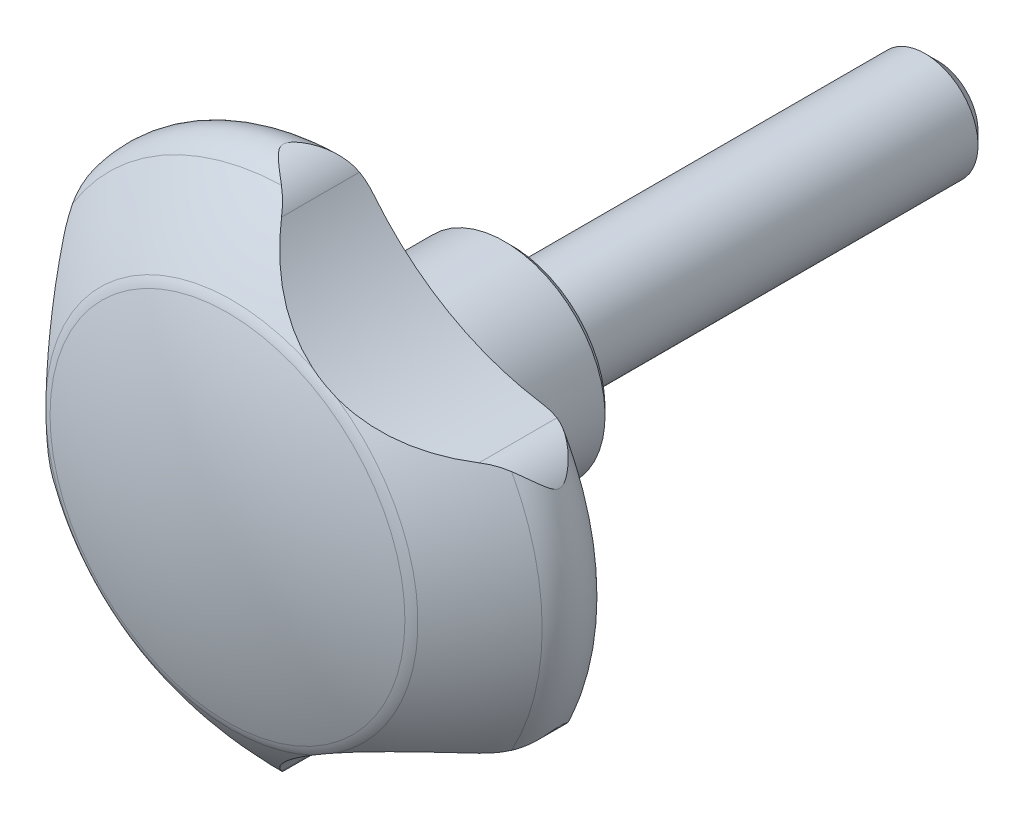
ISO-10303-21;
HEADER;
FILE_DESCRIPTION(('STEP AP214'),'2;1');
FILE_NAME('part.step','',(''),(''),'','','');
FILE_SCHEMA(('AUTOMOTIVE_DESIGN { 1 0 10303 214 1 1 1 1 }'));
ENDSEC;
DATA;
#1=APPLICATION_CONTEXT('core data for automotive mechanical design processes');
#2=APPLICATION_PROTOCOL_DEFINITION('international standard','automotive_design',2000,#1);
#3=PRODUCT_CONTEXT('',#1,'mechanical');
#4=PRODUCT('Part','Part','',(#3));
#5=PRODUCT_RELATED_PRODUCT_CATEGORY('part','',(#4));
#6=PRODUCT_DEFINITION_FORMATION('','',#4);
#7=PRODUCT_DEFINITION_CONTEXT('part definition',#1,'design');
#8=PRODUCT_DEFINITION('design','',#6,#7);
#9=PRODUCT_DEFINITION_SHAPE('','',#8);
#10=(LENGTH_UNIT() NAMED_UNIT(*) SI_UNIT(.MILLI.,.METRE.));
#11=(NAMED_UNIT(*) PLANE_ANGLE_UNIT() SI_UNIT($,.RADIAN.));
#12=(NAMED_UNIT(*) SI_UNIT($,.STERADIAN.) SOLID_ANGLE_UNIT());
#13=UNCERTAINTY_MEASURE_WITH_UNIT(LENGTH_MEASURE(1.E-05),#10,'distance_accuracy_value','');
#14=(GEOMETRIC_REPRESENTATION_CONTEXT(3) GLOBAL_UNCERTAINTY_ASSIGNED_CONTEXT((#13)) GLOBAL_UNIT_ASSIGNED_CONTEXT((#10,
#11,#12)) REPRESENTATION_CONTEXT('',''));
#15=CARTESIAN_POINT('',(0.,0.,0.));
#16=DIRECTION('',(0.,0.,1.));
#17=DIRECTION('',(1.,0.,0.));
#18=AXIS2_PLACEMENT_3D('',#15,#16,#17);
#19=CARTESIAN_POINT('',(0.,0.,18.75));
#20=DIRECTION('',(0.,0.,1.));
#21=DIRECTION('',(0.,-1.,0.));
#22=AXIS2_PLACEMENT_3D('',#19,#20,#21);
#23=TOROIDAL_SURFACE('',#22,21.25,3.75);
#24=CARTESIAN_POINT('',(0.,0.,15.));
#25=DIRECTION('',(0.,0.,1.));
#26=DIRECTION('',(0.,-1.,0.));
#27=AXIS2_PLACEMENT_3D('',#24,#25,#26);
#28=CIRCLE('',#27,21.25);
#29=CARTESIAN_POINT('',(-19.2095588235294,-9.0859974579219,15.));
#30=VERTEX_POINT('',#29);
#31=CARTESIAN_POINT('',(1.73607479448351,-21.1789646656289,15.));
#32=VERTEX_POINT('',#31);
#33=EDGE_CURVE('E339',#30,#32,#28,.T.);
#34=ORIENTED_EDGE('',*,*,#33,.T.);
#35=CARTESIAN_POINT('',(8.75,-15.1554445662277,18.75));
#36=CARTESIAN_POINT('',(8.74498488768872,-15.1583400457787,18.7465048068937));
#37=CARTESIAN_POINT('',(8.73997077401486,-15.1612372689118,18.7430096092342));
#38=CARTESIAN_POINT('',(8.4993134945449,-15.3004037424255,18.5752211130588));
#39=CARTESIAN_POINT('',(8.26586854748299,-15.440528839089,18.41093857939));
#40=CARTESIAN_POINT('',(7.80268506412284,-15.7289792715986,18.0843487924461));
#41=CARTESIAN_POINT('',(7.57294663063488,-15.8773048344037,17.9220415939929));
#42=CARTESIAN_POINT('',(7.11622865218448,-16.1829829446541,17.6011970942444));
#43=CARTESIAN_POINT('',(6.88925336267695,-16.3403476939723,17.4426653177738));
#44=CARTESIAN_POINT('',(6.43788004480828,-16.6646219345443,17.1318173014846));
#45=CARTESIAN_POINT('',(6.21348184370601,-16.8315307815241,16.9795006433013));
#46=CARTESIAN_POINT('',(5.76758448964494,-17.1751404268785,16.6840270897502));
#47=CARTESIAN_POINT('',(5.54607831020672,-17.3518078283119,16.5408421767));
#48=CARTESIAN_POINT('',(5.1049757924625,-17.7162904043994,16.2659140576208));
#49=CARTESIAN_POINT('',(4.88537987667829,-17.9041079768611,16.1341733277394));
#50=CARTESIAN_POINT('',(4.44877375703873,-18.2911215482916,15.8858938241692));
#51=CARTESIAN_POINT('',(4.23175823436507,-18.4902859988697,15.769315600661));
#52=CARTESIAN_POINT('',(3.8002030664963,-18.9009635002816,15.5550818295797));
#53=CARTESIAN_POINT('',(3.58566180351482,-19.1124678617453,15.4574131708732));
#54=CARTESIAN_POINT('',(3.2376169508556,-19.4685064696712,15.3172524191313));
#55=CARTESIAN_POINT('',(3.1031337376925,-19.6092876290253,15.2676363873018));
#56=CARTESIAN_POINT('',(2.83579563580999,-19.8958619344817,15.1795112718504));
#57=CARTESIAN_POINT('',(2.70294088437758,-20.0416554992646,15.1410031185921));
#58=CARTESIAN_POINT('',(2.43997889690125,-20.3372590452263,15.0769376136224));
#59=CARTESIAN_POINT('',(2.30986170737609,-20.4870470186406,15.0513204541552));
#60=CARTESIAN_POINT('',(2.05236733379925,-20.7907586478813,15.0146179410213));
#61=CARTESIAN_POINT('',(1.9249899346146,-20.9446819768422,15.0035314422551));
#62=CARTESIAN_POINT('',(1.69710201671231,-21.226904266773,14.9984199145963));
#63=CARTESIAN_POINT('',(1.59598831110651,-21.3546638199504,15.0016130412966));
#64=CARTESIAN_POINT('',(1.39673032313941,-21.6115378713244,15.0201012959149));
#65=CARTESIAN_POINT('',(1.29858441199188,-21.7406515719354,15.0353896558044));
#66=CARTESIAN_POINT('',(1.10471730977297,-22.0008735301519,15.0794596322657));
#67=CARTESIAN_POINT('',(1.00903821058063,-22.13198738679,15.1083978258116));
#68=CARTESIAN_POINT('',(0.821945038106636,-22.3935585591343,15.1809641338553));
#69=CARTESIAN_POINT('',(0.730539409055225,-22.5240141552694,15.2246200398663));
#70=CARTESIAN_POINT('',(0.64176588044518,-22.653317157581,15.2761534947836));
#71=B_SPLINE_CURVE_WITH_KNOTS('',3,(#35,#36,#37,#38,#39,#40,#41,#42,#43,#44,#45,#46,#47,#48,#49,
#50,#51,#52,#53,#54,#55,#56,#57,#58,#59,#60,#61,#62,#63,#64,#65,#66,#67,#68,#69,#70),
.UNSPECIFIED.,.F.,.F.,(4,2,2,2,2,2,2,2,2,2,2,2,2,2,2,2,2,4),(0.,0.0202919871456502,
0.974127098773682,1.92798862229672,2.88316947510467,3.83828592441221,4.79031492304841,
5.74254939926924,6.69225455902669,7.64129885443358,8.24373030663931,8.84621220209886,
9.44587249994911,10.0454855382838,10.5339430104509,11.0221273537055,11.5160531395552,
12.0109168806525),.UNSPECIFIED.);
#72=CARTESIAN_POINT('',(0.641903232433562,-22.653117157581,15.2760737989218));
#73=VERTEX_POINT('',#72);
#74=EDGE_CURVE('E244',#32,#73,#71,.T.);
#75=ORIENTED_EDGE('',*,*,#74,.T.);
#76=CARTESIAN_POINT('',(-0.666781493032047,-23.9562153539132,21.3362324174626));
#77=CARTESIAN_POINT('',(-0.779040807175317,-24.0326182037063,21.2527113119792));
#78=CARTESIAN_POINT('',(-0.89302919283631,-24.1034851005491,21.166546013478));
#79=CARTESIAN_POINT('',(-1.1233218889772,-24.2344319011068,20.9892190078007));
#80=CARTESIAN_POINT('',(-1.239626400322,-24.2945108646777,20.8980568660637));
#81=CARTESIAN_POINT('',(-1.47220267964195,-24.4035969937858,20.7119920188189));
#82=CARTESIAN_POINT('',(-1.5884627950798,-24.452710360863,20.6171366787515));
#83=CARTESIAN_POINT('',(-1.82073613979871,-24.540913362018,20.4226669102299));
#84=CARTESIAN_POINT('',(-1.93674944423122,-24.5800066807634,20.3230542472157));
#85=CARTESIAN_POINT('',(-2.13876860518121,-24.6402127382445,20.1429497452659));
#86=CARTESIAN_POINT('',(-2.22523948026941,-24.6633872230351,20.0636672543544));
#87=CARTESIAN_POINT('',(-2.39584370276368,-24.7044252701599,19.9005436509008));
#88=CARTESIAN_POINT('',(-2.47996510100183,-24.7222650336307,19.8166840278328));
#89=CARTESIAN_POINT('',(-2.64364796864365,-24.7528283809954,19.6421320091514));
#90=CARTESIAN_POINT('',(-2.72316471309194,-24.7655072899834,19.5513876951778));
#91=CARTESIAN_POINT('',(-2.83329888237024,-24.7807038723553,19.4080637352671));
#92=CARTESIAN_POINT('',(-2.86842549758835,-24.7851273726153,19.3591928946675));
#93=CARTESIAN_POINT('',(-2.93396075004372,-24.7927586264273,19.2583363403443));
#94=CARTESIAN_POINT('',(-2.96437822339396,-24.7959686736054,19.2063567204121));
#95=CARTESIAN_POINT('',(-3.0144821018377,-24.800888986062,19.1055183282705));
#96=CARTESIAN_POINT('',(-3.03504452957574,-24.8027388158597,19.0571145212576));
#97=CARTESIAN_POINT('',(-3.06800460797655,-24.8055734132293,18.9576248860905));
#98=CARTESIAN_POINT('',(-3.08043189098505,-24.8065613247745,18.9065495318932));
#99=CARTESIAN_POINT('',(-3.09365300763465,-24.8076017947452,18.8111290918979));
#100=CARTESIAN_POINT('',(-3.09598202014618,-24.8077780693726,18.7670046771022));
#101=CARTESIAN_POINT('',(-3.09282879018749,-24.8075341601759,18.6790329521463));
#102=CARTESIAN_POINT('',(-3.08734310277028,-24.8071137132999,18.6351857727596));
#103=CARTESIAN_POINT('',(-3.06687973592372,-24.8054649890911,18.5365627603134));
#104=CARTESIAN_POINT('',(-3.04962269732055,-24.8040388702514,18.4822778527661));
#105=CARTESIAN_POINT('',(-3.00692868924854,-24.8001673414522,18.3770209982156));
#106=CARTESIAN_POINT('',(-2.98145974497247,-24.7977179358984,18.3260629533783));
#107=CARTESIAN_POINT('',(-2.91562430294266,-24.790746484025,18.2104467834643));
#108=CARTESIAN_POINT('',(-2.87314027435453,-24.7858023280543,18.1470507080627));
#109=CARTESIAN_POINT('',(-2.78269141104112,-24.7739141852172,18.0244336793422));
#110=CARTESIAN_POINT('',(-2.73471407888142,-24.7669655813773,17.9652227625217));
#111=CARTESIAN_POINT('',(-2.63518542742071,-24.7509448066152,17.8495922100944));
#112=CARTESIAN_POINT('',(-2.58361436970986,-24.7418601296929,17.7931914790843));
#113=CARTESIAN_POINT('',(-2.47843898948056,-24.7215369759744,17.6828562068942));
#114=CARTESIAN_POINT('',(-2.42483664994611,-24.7103005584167,17.6289193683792));
#115=CARTESIAN_POINT('',(-2.24976068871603,-24.6704624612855,17.4578595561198));
#116=CARTESIAN_POINT('',(-2.1256921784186,-24.6374676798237,17.3443925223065));
#117=CARTESIAN_POINT('',(-1.87541516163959,-24.5599799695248,17.1237678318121));
#118=CARTESIAN_POINT('',(-1.74920468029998,-24.5154758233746,17.0166164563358));
#119=CARTESIAN_POINT('',(-1.49721992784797,-24.4147000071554,16.8080924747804));
#120=CARTESIAN_POINT('',(-1.37144532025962,-24.3584555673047,16.7067071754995));
#121=CARTESIAN_POINT('',(-1.12172304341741,-24.2337992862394,16.5094230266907));
#122=CARTESIAN_POINT('',(-0.997774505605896,-24.1653934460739,16.4135215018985));
#123=CARTESIAN_POINT('',(-0.771458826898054,-24.0273046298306,16.2415959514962));
#124=CARTESIAN_POINT('',(-0.668650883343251,-23.9593628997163,16.1647524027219));
#125=CARTESIAN_POINT('',(-0.466126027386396,-23.8142404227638,16.0157740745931));
#126=CARTESIAN_POINT('',(-0.366409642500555,-23.7370581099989,15.9436400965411));
#127=CARTESIAN_POINT('',(-0.171252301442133,-23.5735548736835,15.8049600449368));
#128=CARTESIAN_POINT('',(-0.0758000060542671,-23.4872605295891,15.7383986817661));
#129=CARTESIAN_POINT('',(0.110160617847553,-23.3052961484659,15.6114916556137));
#130=CARTESIAN_POINT('',(0.200670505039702,-23.2096290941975,15.5511440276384));
#131=CARTESIAN_POINT('',(0.350451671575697,-23.0379232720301,15.4540605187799));
#132=CARTESIAN_POINT('',(0.411203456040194,-22.9641817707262,15.4155347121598));
#133=CARTESIAN_POINT('',(0.52929297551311,-22.8120278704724,15.3425770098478));
#134=CARTESIAN_POINT('',(0.586629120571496,-22.733613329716,15.3081470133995));
#135=CARTESIAN_POINT('',(0.642040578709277,-22.652917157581,15.2759941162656));
#136=B_SPLINE_CURVE_WITH_KNOTS('',3,(#76,#77,#78,#79,#80,#81,#82,#83,#84,#85,#86,#87,#88,#89,
#90,#91,#92,#93,#94,#95,#96,#97,#98,#99,#100,#101,#102,#103,#104,#105,#106,#107,#108,#109,#110,
#111,#112,#113,#114,#115,#116,#117,#118,#119,#120,#121,#122,#123,#124,#125,#126,#127,#128,#129,
#130,#131,#132,#133,#134,#135),.UNSPECIFIED.,.F.,.F.,(4,2,2,2,2,2,2,2,2,2,2,2,2,2,2,2,2,2,2,2,2,
2,2,2,2,2,2,2,2,4),(0.,0.478066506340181,0.956174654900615,1.42942941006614,1.90250988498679,
2.26105820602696,2.6211829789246,2.98436206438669,3.16522841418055,3.34575116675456,
3.50311745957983,3.65990730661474,3.79177502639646,3.92370089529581,4.09363538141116,
4.26423970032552,4.49308748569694,4.72246665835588,4.95322376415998,5.18376112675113,
5.69710734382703,6.21095577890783,6.72362538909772,7.23604272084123,7.67134997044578,
8.10673109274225,8.5408755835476,8.97488235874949,9.28370938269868,9.59267905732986),.UNSPECIFIED.);
#137=CARTESIAN_POINT('',(-0.667050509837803,-23.9563984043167,21.3360324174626));
#138=VERTEX_POINT('',#137);
#139=EDGE_CURVE('E262',#138,#73,#136,.T.);
#140=ORIENTED_EDGE('',*,*,#139,.F.);
#141=CARTESIAN_POINT('',(0.,0.,21.3360324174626));
#142=DIRECTION('',(0.,0.,1.));
#143=DIRECTION('',(0.,-1.,0.));
#144=AXIS2_PLACEMENT_3D('',#141,#142,#143);
#145=CIRCLE('',#144,23.9656834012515);
#146=CARTESIAN_POINT('',(-20.4133243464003,-12.5558818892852,21.3360324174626));
#147=VERTEX_POINT('',#146);
#148=EDGE_CURVE('E352',#147,#138,#145,.T.);
#149=ORIENTED_EDGE('',*,*,#148,.F.);
#150=CARTESIAN_POINT('',(-19.939031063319,-10.7704540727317,15.2760010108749));
#151=CARTESIAN_POINT('',(-20.0050283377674,-10.9086558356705,15.3263308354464));
#152=CARTESIAN_POINT('',(-20.0638003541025,-11.0480982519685,15.3821742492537));
#153=CARTESIAN_POINT('',(-20.1673827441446,-11.3277657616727,15.5031978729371));
#154=CARTESIAN_POINT('',(-20.2122212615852,-11.4679886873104,15.5683588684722));
#155=CARTESIAN_POINT('',(-20.2885179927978,-11.7474655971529,15.7062356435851));
#156=CARTESIAN_POINT('',(-20.3200351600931,-11.8867211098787,15.7789163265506));
#157=CARTESIAN_POINT('',(-20.3707269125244,-12.1638995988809,15.9309548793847));
#158=CARTESIAN_POINT('',(-20.3898943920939,-12.3018217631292,16.0103165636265));
#159=CARTESIAN_POINT('',(-20.41824038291,-12.5919434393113,16.1847706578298));
#160=CARTESIAN_POINT('',(-20.4259231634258,-12.7438427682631,16.2806030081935));
#161=CARTESIAN_POINT('',(-20.427787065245,-13.043519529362,16.4786223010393));
#162=CARTESIAN_POINT('',(-20.4219661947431,-13.1912963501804,16.580810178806));
#163=CARTESIAN_POINT('',(-20.3980121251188,-13.4812904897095,16.7910102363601));
#164=CARTESIAN_POINT('',(-20.3798953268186,-13.6235149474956,16.8990144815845));
#165=CARTESIAN_POINT('',(-20.3327283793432,-13.9010593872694,17.1211871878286));
#166=CARTESIAN_POINT('',(-20.3036846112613,-14.0363833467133,17.2353520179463));
#167=CARTESIAN_POINT('',(-20.2487068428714,-14.2507406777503,17.4290773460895));
#168=CARTESIAN_POINT('',(-20.2254029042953,-14.3325341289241,17.5063383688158));
#169=CARTESIAN_POINT('',(-20.1759550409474,-14.4912780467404,17.6653563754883));
#170=CARTESIAN_POINT('',(-20.1498022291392,-14.5682121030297,17.7471270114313));
#171=CARTESIAN_POINT('',(-20.0959194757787,-14.715561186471,17.9178762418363));
#172=CARTESIAN_POINT('',(-20.0681749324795,-14.7858917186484,18.0069264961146));
#173=CARTESIAN_POINT('',(-20.0285289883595,-14.8809777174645,18.1478405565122));
#174=CARTESIAN_POINT('',(-20.0156706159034,-14.9108788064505,18.1959111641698));
#175=CARTESIAN_POINT('',(-19.9915548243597,-14.9656875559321,18.2951518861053));
#176=CARTESIAN_POINT('',(-19.9802939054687,-14.9906061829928,18.3463148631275));
#177=CARTESIAN_POINT('',(-19.9620564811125,-15.0303117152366,18.4451176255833));
#178=CARTESIAN_POINT('',(-19.9547077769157,-15.0460096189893,18.4923085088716));
#179=CARTESIAN_POINT('',(-19.9434458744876,-15.0698868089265,18.5888820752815));
#180=CARTESIAN_POINT('',(-19.9395203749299,-15.0780930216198,18.6382562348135));
#181=CARTESIAN_POINT('',(-19.9359663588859,-15.0855282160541,18.7383503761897));
#182=CARTESIAN_POINT('',(-19.9363784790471,-15.0846722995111,18.7890786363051));
#183=CARTESIAN_POINT('',(-19.9414927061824,-15.0739589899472,18.889382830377));
#184=CARTESIAN_POINT('',(-19.9462039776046,-15.064082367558,18.9389560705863));
#185=CARTESIAN_POINT('',(-19.9607791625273,-15.0330474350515,19.0502572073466));
#186=CARTESIAN_POINT('',(-19.971774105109,-15.0093721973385,19.1110985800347));
#187=CARTESIAN_POINT('',(-19.9967550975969,-14.9540281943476,19.2284300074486));
#188=CARTESIAN_POINT('',(-20.0107539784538,-14.9223250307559,19.2848999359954));
#189=CARTESIAN_POINT('',(-20.048100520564,-14.8348377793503,19.4245424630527));
#190=CARTESIAN_POINT('',(-20.0723291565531,-14.7754462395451,19.505166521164));
#191=CARTESIAN_POINT('',(-20.1205404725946,-14.6495558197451,19.6608254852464));
#192=CARTESIAN_POINT('',(-20.1445224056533,-14.583039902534,19.7358462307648));
#193=CARTESIAN_POINT('',(-20.1908743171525,-14.4447826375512,19.8823943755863));
#194=CARTESIAN_POINT('',(-20.2132328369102,-14.3730102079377,19.9538959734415));
#195=CARTESIAN_POINT('',(-20.2552915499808,-14.2259357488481,20.0938014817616));
#196=CARTESIAN_POINT('',(-20.2749943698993,-14.1506373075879,20.1622084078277));
#197=CARTESIAN_POINT('',(-20.3209136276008,-13.9561680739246,20.3324653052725));
#198=CARTESIAN_POINT('',(-20.34499093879,-13.8350387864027,20.4326698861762));
#199=CARTESIAN_POINT('',(-20.3844246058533,-13.5875110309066,20.6282828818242));
#200=CARTESIAN_POINT('',(-20.3997763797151,-13.4611098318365,20.723688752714));
#201=CARTESIAN_POINT('',(-20.4206049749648,-13.2065858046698,20.9080353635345));
#202=CARTESIAN_POINT('',(-20.4262663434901,-13.0785430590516,20.99706524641));
#203=CARTESIAN_POINT('',(-20.4275210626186,-12.8192577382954,21.1703181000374));
#204=CARTESIAN_POINT('',(-20.4231172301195,-12.6880160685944,21.2545424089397));
#205=CARTESIAN_POINT('',(-20.4133003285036,-12.5555573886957,21.3362324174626));
#206=B_SPLINE_CURVE_WITH_KNOTS('',3,(#150,#151,#152,#153,#154,#155,#156,#157,#158,#159,#160,
#161,#162,#163,#164,#165,#166,#167,#168,#169,#170,#171,#172,#173,#174,#175,#176,#177,#178,#179,
#180,#181,#182,#183,#184,#185,#186,#187,#188,#189,#190,#191,#192,#193,#194,#195,#196,#197,#198,
#199,#200,#201,#202,#203,#204,#205),.UNSPECIFIED.,.F.,.F.,(4,2,2,2,2,2,2,2,2,2,2,2,2,2,2,2,2,2,
2,2,2,2,2,2,2,2,2,4),(0.,0.483118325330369,0.965254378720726,1.44523381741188,1.92548917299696,
2.46406656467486,3.00272340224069,3.54066316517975,4.07828927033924,4.42280829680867,
4.76843461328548,5.11800857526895,5.29196411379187,5.46553245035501,5.61580302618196,
5.76553135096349,5.91666363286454,6.06811883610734,6.26561792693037,6.46397802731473,
6.77228653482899,7.08134952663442,7.39241624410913,7.70317300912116,8.17985294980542,
8.65678297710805,9.12452475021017,9.59213563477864),.UNSPECIFIED.);
#207=CARTESIAN_POINT('',(-19.9391265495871,-10.7706540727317,15.2760737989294));
#208=VERTEX_POINT('',#207);
#209=EDGE_CURVE('E194',#208,#147,#206,.T.);
#210=ORIENTED_EDGE('',*,*,#209,.F.);
#211=CARTESIAN_POINT('',(-17.5,0.,18.75));
#212=CARTESIAN_POINT('',(-17.5000000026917,-0.00579095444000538,18.7465048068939));
#213=CARTESIAN_POINT('',(-17.5000020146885,-0.0115819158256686,18.7430096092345));
#214=CARTESIAN_POINT('',(-17.5001950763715,-0.289580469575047,18.5752211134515));
#215=CARTESIAN_POINT('',(-17.5048244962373,-0.561812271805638,18.4109385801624));
#216=CARTESIAN_POINT('',(-17.5230381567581,-1.10716614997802,18.0843487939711));
#217=CARTESIAN_POINT('',(-17.5366226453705,-1.38028825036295,17.9220415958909));
#218=CARTESIAN_POINT('',(-17.5729886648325,-1.92865667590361,17.6011970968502));
#219=CARTESIAN_POINT('',(-17.5957828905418,-2.20390541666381,17.4426653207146));
#220=CARTESIAN_POINT('',(-17.6509259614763,-2.75694329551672,17.1318173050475));
#221=CARTESIAN_POINT('',(-17.6832741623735,-3.03473226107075,16.9795006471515));
#222=CARTESIAN_POINT('',(-17.7579001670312,-3.59269551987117,16.6840270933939));
#223=CARTESIAN_POINT('',(-17.8001455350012,-3.87285919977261,16.540842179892));
#224=CARTESIAN_POINT('',(-17.8952454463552,-4.43710647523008,16.2659140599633));
#225=CARTESIAN_POINT('',(-17.9481022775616,-4.72119090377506,16.1341733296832));
#226=CARTESIAN_POINT('',(-18.0649628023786,-5.29280968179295,15.885893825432));
#227=CARTESIAN_POINT('',(-18.1289365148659,-5.58033286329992,15.7693156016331));
#228=CARTESIAN_POINT('',(-18.2688160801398,-6.15940935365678,15.5550818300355));
#229=CARTESIAN_POINT('',(-18.3447135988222,-6.45095971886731,15.45741317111));
#230=CARTESIAN_POINT('',(-18.4790297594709,-6.93039509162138,15.3172523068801));
#231=CARTESIAN_POINT('',(-18.5337083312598,-7.11725193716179,15.2676361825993));
#232=CARTESIAN_POINT('',(-18.6482201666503,-7.49206145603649,15.1795109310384));
#233=CARTESIAN_POINT('',(-18.7080538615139,-7.68001421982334,15.1410027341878));
#234=CARTESIAN_POINT('',(-18.8325733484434,-8.05554853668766,15.0769372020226));
#235=CARTESIAN_POINT('',(-18.8972351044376,-8.24312770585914,15.051320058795));
#236=CARTESIAN_POINT('',(-19.0315102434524,-8.61798096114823,15.0146176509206));
#237=CARTESIAN_POINT('',(-19.101123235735,-8.80525507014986,15.0035312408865));
#238=CARTESIAN_POINT('',(-19.2315903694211,-9.14372123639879,14.9984199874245));
#239=CARTESIAN_POINT('',(-19.2916757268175,-9.29516598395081,15.0016131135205));
#240=CARTESIAN_POINT('',(-19.4145044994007,-9.59616141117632,15.0201010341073));
#241=CARTESIAN_POINT('',(-19.4772464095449,-9.74571310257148,15.0353890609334));
#242=CARTESIAN_POINT('',(-19.6056698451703,-10.0437139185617,15.0794579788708));
#243=CARTESIAN_POINT('',(-19.6713772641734,-10.192129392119,15.1083954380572));
#244=CARTESIAN_POINT('',(-19.8043560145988,-10.4849385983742,15.180959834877));
#245=CARTESIAN_POINT('',(-19.8716300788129,-10.6293241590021,15.2246145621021));
#246=CARTESIAN_POINT('',(-19.9392220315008,-10.7708540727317,15.2761465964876));
#247=B_SPLINE_CURVE_WITH_KNOTS('',3,(#211,#212,#213,#214,#215,#216,#217,#218,#219,#220,#221,
#222,#223,#224,#225,#226,#227,#228,#229,#230,#231,#232,#233,#234,#235,#236,#237,#238,#239,#240,
#241,#242,#243,#244,#245,#246),.UNSPECIFIED.,.F.,.F.,(4,2,2,2,2,2,2,2,2,2,2,2,2,2,2,2,2,4),(0.,
0.0202919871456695,0.974127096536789,1.92798861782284,2.88316946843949,3.83828591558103,
4.79031491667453,5.74254939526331,6.69225455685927,7.64129885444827,8.24373154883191,
8.84621468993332,9.44587623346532,10.0454905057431,10.5339413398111,11.0221190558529,
11.5160379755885,12.0108948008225),.UNSPECIFIED.);
#248=EDGE_CURVE('E133',#208,#30,#247,.F.);
#249=ORIENTED_EDGE('',*,*,#248,.T.);
#250=EDGE_LOOP('',(#34,#75,#140,#149,#210,#249));
#251=FACE_BOUND('',#250,.T.);
#252=ADVANCED_FACE('F14',(#251),#23,.T.);
#253=CARTESIAN_POINT('',(0.64204057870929,22.652917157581,15.2759941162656));
#254=CARTESIAN_POINT('',(0.555353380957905,22.7791739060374,15.3263234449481));
#255=CARTESIAN_POINT('',(0.463979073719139,22.8997937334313,15.3821664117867));
#256=CARTESIAN_POINT('',(0.273571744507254,23.1293335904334,15.5031892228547));
#257=CARTESIAN_POINT('',(0.174554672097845,23.2382769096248,15.5683498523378));
#258=CARTESIAN_POINT('',(-0.0293305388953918,23.4440913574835,15.7062259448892));
#259=CARTESIAN_POINT('',(-0.134170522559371,23.5410143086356,15.7789063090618));
#260=CARTESIAN_POINT('',(-0.348867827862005,23.7235049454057,15.9309442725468));
#261=CARTESIAN_POINT('',(-0.458727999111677,23.8090660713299,16.0103056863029));
#262=CARTESIAN_POINT('',(-0.695807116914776,23.9786761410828,16.1847590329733));
#263=CARTESIAN_POINT('',(-0.823513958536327,24.0612796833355,16.2805908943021));
#264=CARTESIAN_POINT('',(-1.08210885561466,24.2127330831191,16.478609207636));
#265=CARTESIAN_POINT('',(-1.21299737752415,24.2815809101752,16.5807965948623));
#266=CARTESIAN_POINT('',(-1.47611600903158,24.4058340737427,16.7909956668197));
#267=CARTESIAN_POINT('',(-1.60834410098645,24.4612571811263,16.8989994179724));
#268=CARTESIAN_POINT('',(-1.8722876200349,24.5591826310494,17.1211710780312));
#269=CARTESIAN_POINT('',(-2.00400330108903,24.6016924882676,17.2353353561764));
#270=CARTESIAN_POINT('',(-2.21713195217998,24.6612601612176,17.429060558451));
#271=CARTESIAN_POINT('',(-2.2996201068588,24.6819756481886,17.5063220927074));
#272=CARTESIAN_POINT('',(-2.4618223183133,24.7185255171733,17.6653410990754));
#273=CARTESIAN_POINT('',(-2.5415266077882,24.7343439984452,17.747112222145));
#274=CARTESIAN_POINT('',(-2.69607819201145,24.7613555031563,17.9178623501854));
#275=CARTESIAN_POINT('',(-2.77085961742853,24.7724936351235,18.0069130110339));
#276=CARTESIAN_POINT('',(-2.87303137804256,24.7857026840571,18.1478276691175));
#277=CARTESIAN_POINT('',(-2.90535633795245,24.789517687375,18.1958984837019));
#278=CARTESIAN_POINT('',(-2.96488143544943,24.7960374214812,18.2951396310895));
#279=CARTESIAN_POINT('',(-2.99209281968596,24.7987446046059,18.3463028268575));
#280=CARTESIAN_POINT('',(-3.03559903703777,24.8028034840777,18.445106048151));
#281=CARTESIAN_POINT('',(-3.05286890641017,24.8042883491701,18.4922971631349));
#282=CARTESIAN_POINT('',(-3.07917959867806,24.8064739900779,18.5888712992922));
#283=CARTESIAN_POINT('',(-3.08824989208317,24.8071775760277,18.6382457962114));
#284=CARTESIAN_POINT('',(-3.09646736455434,24.8078174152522,18.7383408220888));
#285=CARTESIAN_POINT('',(-3.09552068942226,24.8077464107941,18.7890696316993));
#286=CARTESIAN_POINT('',(-3.08368654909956,24.8068188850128,18.8893749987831));
#287=CARTESIAN_POINT('',(-3.07277784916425,24.8059606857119,18.938948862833));
#288=CARTESIAN_POINT('',(-3.03861415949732,24.8030657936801,19.0502498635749));
#289=CARTESIAN_POINT('',(-3.01261416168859,24.8007501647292,19.1110905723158));
#290=CARTESIAN_POINT('',(-2.95219604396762,24.7947125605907,19.2284207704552));
#291=CARTESIAN_POINT('',(-2.91774171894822,24.7909844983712,19.2848901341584));
#292=CARTESIAN_POINT('',(-2.82330501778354,24.7795843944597,19.4245304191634));
#293=CARTESIAN_POINT('',(-2.75975811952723,24.7708716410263,19.5051529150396));
#294=CARTESIAN_POINT('',(-2.62663219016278,24.7496796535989,19.66080887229));
#295=CARTESIAN_POINT('',(-2.5570387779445,24.7371912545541,19.7358281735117));
#296=CARTESIAN_POINT('',(-2.41413255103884,24.7082059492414,19.8823735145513));
#297=CARTESIAN_POINT('',(-2.34079854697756,24.6916835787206,19.9538737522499));
#298=CARTESIAN_POINT('',(-2.19240293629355,24.6545720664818,20.0937766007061));
#299=CARTESIAN_POINT('',(-2.11734312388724,24.6339869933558,20.1621822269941));
#300=CARTESIAN_POINT('',(-1.92596765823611,24.5765208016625,20.332440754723));
#301=CARTESIAN_POINT('',(-1.80902532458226,24.5368075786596,20.4326480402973));
#302=CARTESIAN_POINT('',(-1.57493778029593,24.4471935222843,20.6282662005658));
#303=CARTESIAN_POINT('',(-1.45779249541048,24.397287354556,20.7236745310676));
#304=CARTESIAN_POINT('',(-1.22694864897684,24.2880618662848,20.908025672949));
#305=CARTESIAN_POINT('',(-1.11322716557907,24.2289424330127,20.9970576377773));
#306=CARTESIAN_POINT('',(-0.888047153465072,24.1003840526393,21.1703144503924));
#307=CARTESIAN_POINT('',(-0.776588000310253,24.0309479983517,21.2545406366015));
#308=CARTESIAN_POINT('',(-0.666781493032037,23.9562153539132,21.3362324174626));
#309=B_SPLINE_CURVE_WITH_KNOTS('',3,(#253,#254,#255,#256,#257,#258,#259,#260,#261,#262,#263,
#264,#265,#266,#267,#268,#269,#270,#271,#272,#273,#274,#275,#276,#277,#278,#279,#280,#281,#282,
#283,#284,#285,#286,#287,#288,#289,#290,#291,#292,#293,#294,#295,#296,#297,#298,#299,#300,#301,
#302,#303,#304,#305,#306,#307,#308),.UNSPECIFIED.,.F.,.F.,(4,2,2,2,2,2,2,2,2,2,2,2,2,2,2,2,2,2,
2,2,2,2,2,2,2,2,2,4),(0.,0.48311849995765,0.965254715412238,1.44523419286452,1.92548959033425,
2.46406579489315,3.00272143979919,3.54066009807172,4.07828510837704,4.42280757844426,
4.76843726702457,5.11801444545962,5.29197165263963,5.46554166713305,5.61581366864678,
5.7655433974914,5.91667725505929,6.06813401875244,6.26563030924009,6.46398759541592,
6.7722886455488,7.08134416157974,7.39240344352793,7.70315278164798,8.17984372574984,
8.65678478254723,9.12453669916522,9.59215770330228),.UNSPECIFIED.);
#310=CARTESIAN_POINT('',(0.641903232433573,22.653117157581,15.2760737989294));
#311=VERTEX_POINT('',#310);
#312=CARTESIAN_POINT('',(-0.667050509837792,23.9563984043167,21.3360324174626));
#313=VERTEX_POINT('',#312);
#314=EDGE_CURVE('E282',#311,#313,#309,.T.);
#315=ORIENTED_EDGE('',*,*,#314,.F.);
#316=CARTESIAN_POINT('',(8.75,15.1554445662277,18.75));
#317=CARTESIAN_POINT('',(8.74498488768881,15.1583400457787,18.7465048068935));
#318=CARTESIAN_POINT('',(8.73997077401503,15.1612372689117,18.7430096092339));
#319=CARTESIAN_POINT('',(8.49931349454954,15.3004037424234,18.5752211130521));
#320=CARTESIAN_POINT('',(8.2658685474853,15.4405288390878,18.410938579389));
#321=CARTESIAN_POINT('',(7.80268506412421,15.7289792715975,18.0843487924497));
#322=CARTESIAN_POINT('',(7.57294663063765,15.8773048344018,17.9220415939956));
#323=CARTESIAN_POINT('',(7.11622865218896,16.1829829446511,17.6011970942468));
#324=CARTESIAN_POINT('',(6.88925336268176,16.3403476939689,17.442665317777));
#325=CARTESIAN_POINT('',(6.43788004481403,16.66462193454,17.1318173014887));
#326=CARTESIAN_POINT('',(6.21348184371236,16.8315307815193,16.9795006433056));
#327=CARTESIAN_POINT('',(5.76758448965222,17.1751404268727,16.684027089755));
#328=CARTESIAN_POINT('',(5.54607831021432,17.3518078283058,16.5408421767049));
#329=CARTESIAN_POINT('',(5.10497579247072,17.7162904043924,16.2659140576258));
#330=CARTESIAN_POINT('',(4.88537987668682,17.9041079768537,16.1341733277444));
#331=CARTESIAN_POINT('',(4.44877375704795,18.2911215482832,15.8858938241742));
#332=CARTESIAN_POINT('',(4.23175823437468,18.4902859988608,15.7693156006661));
#333=CARTESIAN_POINT('',(3.80020306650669,18.9009635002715,15.5550818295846));
#334=CARTESIAN_POINT('',(3.58566180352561,19.1124678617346,15.4574131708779));
#335=CARTESIAN_POINT('',(3.23761695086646,19.46850646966,15.3172524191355));
#336=CARTESIAN_POINT('',(3.10313373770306,19.6092876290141,15.2676363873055));
#337=CARTESIAN_POINT('',(2.83579563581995,19.8958619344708,15.1795112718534));
#338=CARTESIAN_POINT('',(2.70294088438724,20.0416554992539,15.1410031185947));
#339=CARTESIAN_POINT('',(2.43997889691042,20.3372590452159,15.0769376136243));
#340=CARTESIAN_POINT('',(2.30986170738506,20.4870470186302,15.0513204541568));
#341=CARTESIAN_POINT('',(2.05236733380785,20.790758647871,15.0146179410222));
#342=CARTESIAN_POINT('',(1.92498993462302,20.944681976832,15.0035314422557));
#343=CARTESIAN_POINT('',(1.69710201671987,21.2269042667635,14.9984199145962));
#344=CARTESIAN_POINT('',(1.5959883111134,21.3546638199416,15.0016130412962));
#345=CARTESIAN_POINT('',(1.39673032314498,21.6115378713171,15.0201012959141));
#346=CARTESIAN_POINT('',(1.29858441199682,21.7406515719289,15.0353896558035));
#347=CARTESIAN_POINT('',(1.10471730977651,22.0008735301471,15.0794596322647));
#348=CARTESIAN_POINT('',(1.00903821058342,22.1319873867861,15.1083978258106));
#349=CARTESIAN_POINT('',(0.821945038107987,22.3935585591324,15.1809641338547));
#350=CARTESIAN_POINT('',(0.730539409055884,22.5240141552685,15.2246200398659));
#351=CARTESIAN_POINT('',(0.641765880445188,22.653317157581,15.2761534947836));
#352=B_SPLINE_CURVE_WITH_KNOTS('',3,(#316,#317,#318,#319,#320,#321,#322,#323,#324,#325,#326,
#327,#328,#329,#330,#331,#332,#333,#334,#335,#336,#337,#338,#339,#340,#341,#342,#343,#344,#345,
#346,#347,#348,#349,#350,#351),.UNSPECIFIED.,.F.,.F.,(4,2,2,2,2,2,2,2,2,2,2,2,2,2,2,2,2,4),(0.,
0.0202919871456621,0.974127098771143,1.92798862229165,2.88316947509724,3.83828592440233,
4.79031492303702,5.74254939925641,6.69225455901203,7.64129885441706,8.24373030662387,
8.8462122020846,9.44587249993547,10.0454855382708,10.5339430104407,11.0221273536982,
11.5160531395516,12.0109168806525),.UNSPECIFIED.);
#353=CARTESIAN_POINT('',(1.73607479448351,21.1789646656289,15.));
#354=VERTEX_POINT('',#353);
#355=EDGE_CURVE('E252',#311,#354,#352,.F.);
#356=ORIENTED_EDGE('',*,*,#355,.T.);
#357=CARTESIAN_POINT('',(-19.2095588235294,9.08599745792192,15.));
#358=VERTEX_POINT('',#357);
#359=EDGE_CURVE('E345',#354,#358,#28,.T.);
#360=ORIENTED_EDGE('',*,*,#359,.T.);
#361=CARTESIAN_POINT('',(-17.5,0.,18.75));
#362=CARTESIAN_POINT('',(-17.5000000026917,0.00579095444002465,18.7465048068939));
#363=CARTESIAN_POINT('',(-17.5000020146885,0.0115819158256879,18.7430096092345));
#364=CARTESIAN_POINT('',(-17.5001950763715,0.289580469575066,18.5752211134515));
#365=CARTESIAN_POINT('',(-17.5048244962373,0.561812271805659,18.4109385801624));
#366=CARTESIAN_POINT('',(-17.5230381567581,1.10716614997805,18.0843487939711));
#367=CARTESIAN_POINT('',(-17.5366226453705,1.38028825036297,17.9220415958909));
#368=CARTESIAN_POINT('',(-17.5729886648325,1.92865667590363,17.6011970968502));
#369=CARTESIAN_POINT('',(-17.5957828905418,2.20390541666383,17.4426653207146));
#370=CARTESIAN_POINT('',(-17.6509259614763,2.75694329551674,17.1318173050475));
#371=CARTESIAN_POINT('',(-17.6832741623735,3.03473226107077,16.9795006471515));
#372=CARTESIAN_POINT('',(-17.7579001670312,3.59269551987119,16.6840270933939));
#373=CARTESIAN_POINT('',(-17.8001455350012,3.87285919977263,16.540842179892));
#374=CARTESIAN_POINT('',(-17.8952454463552,4.43710647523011,16.2659140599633));
#375=CARTESIAN_POINT('',(-17.9481022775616,4.72119090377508,16.1341733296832));
#376=CARTESIAN_POINT('',(-18.0649628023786,5.29280968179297,15.885893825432));
#377=CARTESIAN_POINT('',(-18.1289365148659,5.58033286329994,15.7693156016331));
#378=CARTESIAN_POINT('',(-18.2688160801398,6.1594093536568,15.5550818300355));
#379=CARTESIAN_POINT('',(-18.3447135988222,6.45095971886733,15.45741317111));
#380=CARTESIAN_POINT('',(-18.4790297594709,6.9303950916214,15.3172523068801));
#381=CARTESIAN_POINT('',(-18.5337083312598,7.11725193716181,15.2676361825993));
#382=CARTESIAN_POINT('',(-18.6482201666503,7.49206145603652,15.1795109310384));
#383=CARTESIAN_POINT('',(-18.7080538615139,7.68001421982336,15.1410027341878));
#384=CARTESIAN_POINT('',(-18.8325733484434,8.05554853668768,15.0769372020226));
#385=CARTESIAN_POINT('',(-18.8972351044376,8.24312770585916,15.051320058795));
#386=CARTESIAN_POINT('',(-19.0315102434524,8.61798096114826,15.0146176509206));
#387=CARTESIAN_POINT('',(-19.101123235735,8.80525507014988,15.0035312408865));
#388=CARTESIAN_POINT('',(-19.2315903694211,9.14372123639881,14.9984199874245));
#389=CARTESIAN_POINT('',(-19.2916757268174,9.29516598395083,15.0016131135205));
#390=CARTESIAN_POINT('',(-19.4145044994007,9.59616141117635,15.0201010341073));
#391=CARTESIAN_POINT('',(-19.4772464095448,9.74571310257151,15.0353890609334));
#392=CARTESIAN_POINT('',(-19.6056698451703,10.0437139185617,15.0794579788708));
#393=CARTESIAN_POINT('',(-19.6713772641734,10.192129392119,15.1083954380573));
#394=CARTESIAN_POINT('',(-19.8043560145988,10.4849385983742,15.180959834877));
#395=CARTESIAN_POINT('',(-19.8716300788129,10.6293241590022,15.2246145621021));
#396=CARTESIAN_POINT('',(-19.9392220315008,10.7708540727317,15.2761465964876));
#397=B_SPLINE_CURVE_WITH_KNOTS('',3,(#361,#362,#363,#364,#365,#366,#367,#368,#369,#370,#371,
#372,#373,#374,#375,#376,#377,#378,#379,#380,#381,#382,#383,#384,#385,#386,#387,#388,#389,#390,
#391,#392,#393,#394,#395,#396),.UNSPECIFIED.,.F.,.F.,(4,2,2,2,2,2,2,2,2,2,2,2,2,2,2,2,2,4),(0.,
0.0202919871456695,0.974127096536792,1.92798861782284,2.88316946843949,3.83828591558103,
4.79031491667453,5.74254939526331,6.69225455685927,7.64129885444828,8.24373154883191,
8.84621468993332,9.44587623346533,10.0454905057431,10.5339413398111,11.0221190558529,
11.5160379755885,12.0108948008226),.UNSPECIFIED.);
#398=CARTESIAN_POINT('',(-19.9391265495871,10.7706540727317,15.2760737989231));
#399=VERTEX_POINT('',#398);
#400=EDGE_CURVE('E226',#358,#399,#397,.T.);
#401=ORIENTED_EDGE('',*,*,#400,.T.);
#402=CARTESIAN_POINT('',(-20.4133003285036,12.5555573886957,21.3362324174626));
#403=CARTESIAN_POINT('',(-20.4233374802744,12.6909782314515,21.2527113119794));
#404=CARTESIAN_POINT('',(-20.4277158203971,12.8251285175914,21.1665460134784));
#405=CARTESIAN_POINT('',(-20.425972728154,13.0900412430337,20.9892190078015));
#406=CARTESIAN_POINT('',(-20.419850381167,13.2208033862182,20.8980568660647));
#407=CARTESIAN_POINT('',(-20.3980336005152,13.476763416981,20.71199201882));
#408=CARTESIAN_POINT('',(-20.3824369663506,13.602004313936,20.6171366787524));
#409=CARTESIAN_POINT('',(-20.3426863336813,13.8472604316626,20.4226669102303));
#410=CARTESIAN_POINT('',(-20.3185354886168,13.9672775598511,20.3230542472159));
#411=CARTESIAN_POINT('',(-20.269665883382,14.1723343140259,20.1429497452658));
#412=CARTESIAN_POINT('',(-20.2465001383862,14.2588075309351,20.0636672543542));
#413=CARTESIAN_POINT('',(-20.1967380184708,14.4270741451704,19.9005436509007));
#414=CARTESIAN_POINT('',(-20.170127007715,14.5088452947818,19.8166840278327));
#415=CARTESIAN_POINT('',(-20.1147542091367,14.6658804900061,19.6421320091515));
#416=CARTESIAN_POINT('',(-20.0859760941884,14.7410834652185,19.5513876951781));
#417=CARTESIAN_POINT('',(-20.0440696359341,14.8440607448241,19.4080637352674));
#418=CARTESIAN_POINT('',(-20.0303371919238,14.876693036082,19.3591928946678));
#419=CARTESIAN_POINT('',(-20.00417842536,14.9372638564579,19.2583363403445));
#420=CARTESIAN_POINT('',(-19.9917496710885,14.9652111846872,19.2063567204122));
#421=CARTESIAN_POINT('',(-19.9709588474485,15.011062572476,19.1055183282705));
#422=CARTESIAN_POINT('',(-19.962279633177,15.0297950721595,19.0571145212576));
#423=CARTESIAN_POINT('',(-19.9482544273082,15.0597566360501,18.9576248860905));
#424=CARTESIAN_POINT('',(-19.9428963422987,15.071012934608,18.9065495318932));
#425=CARTESIAN_POINT('',(-19.9371868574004,15.0829829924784,18.8111290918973));
#426=CARTESIAN_POINT('',(-19.93617500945,15.0850881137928,18.7670046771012));
#427=CARTESIAN_POINT('',(-19.9375403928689,15.0822353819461,18.6790329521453));
#428=CARTESIAN_POINT('',(-19.9399191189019,15.0772744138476,18.6351857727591));
#429=CARTESIAN_POINT('',(-19.9487229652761,15.0587282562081,18.5365627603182));
#430=CARTESIAN_POINT('',(-19.9561164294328,15.0430701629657,18.4822778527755));
#431=CARTESIAN_POINT('',(-19.9741105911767,15.0041603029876,18.3770209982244));
#432=CARTESIAN_POINT('',(-19.9847238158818,14.9808788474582,18.3260629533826));
#433=CARTESIAN_POINT('',(-20.0116040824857,14.9203779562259,18.2104467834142));
#434=CARTESIAN_POINT('',(-20.0285643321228,14.8811136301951,18.1470507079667));
#435=CARTESIAN_POINT('',(-20.0634933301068,14.7968385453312,18.0244336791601));
#436=CARTESIAN_POINT('',(-20.0814643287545,14.7518146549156,17.9652227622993));
#437=CARTESIAN_POINT('',(-20.1173542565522,14.6576099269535,17.8495922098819));
#438=CARTESIAN_POINT('',(-20.1352722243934,14.6084057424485,17.7931914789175));
#439=CARTESIAN_POINT('',(-20.1702595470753,14.5071596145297,17.6828562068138));
#440=CARTESIAN_POINT('',(-20.1873296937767,14.4551204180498,17.6289193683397));
#441=CARTESIAN_POINT('',(-20.240366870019,14.2835811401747,17.4578595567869));
#442=CARTESIAN_POINT('',(-20.2738268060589,14.1596372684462,17.3443925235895));
#443=CARTESIAN_POINT('',(-20.3318589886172,13.9041471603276,17.1237678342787));
#444=CARTESIAN_POINT('',(-20.3564225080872,13.7725936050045,17.0166164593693));
#445=CARTESIAN_POINT('',(-20.3951404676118,13.5039805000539,16.8080924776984));
#446=CARTESIAN_POINT('',(-20.4093186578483,13.3669342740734,16.7067071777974));
#447=CARTESIAN_POINT('',(-20.426224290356,13.0883402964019,16.5094230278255));
#448=CARTESIAN_POINT('',(-20.4289573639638,12.9467947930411,16.4135215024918));
#449=CARTESIAN_POINT('',(-20.4225267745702,12.6817550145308,16.2415957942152));
#450=CARTESIAN_POINT('',(-20.4150914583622,12.5587496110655,16.16475209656));
#451=CARTESIAN_POINT('',(-20.3906740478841,12.3107962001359,16.0157734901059));
#452=CARTESIAN_POINT('',(-20.3736903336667,12.1858478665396,15.9436393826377));
#453=CARTESIAN_POINT('',(-20.3296708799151,11.9350845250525,15.8049590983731));
#454=CARTESIAN_POINT('',(-20.3026638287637,11.8092729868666,15.7383976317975));
#455=CARTESIAN_POINT('',(-20.2380581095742,11.5572436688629,15.6114904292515));
#456=CARTESIAN_POINT('',(-20.2004628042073,11.4310260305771,15.5511427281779));
#457=CARTESIAN_POINT('',(-20.126652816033,11.2154622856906,15.4540608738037));
#458=CARTESIAN_POINT('',(-20.0931681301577,11.1259826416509,15.4155366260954));
#459=CARTESIAN_POINT('',(-20.0204470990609,10.9476445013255,15.342581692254));
#460=CARTESIAN_POINT('',(-19.9812081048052,10.8587863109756,15.3081529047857));
#461=CARTESIAN_POINT('',(-19.939031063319,10.7704540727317,15.2760010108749));
#462=B_SPLINE_CURVE_WITH_KNOTS('',3,(#402,#403,#404,#405,#406,#407,#408,#409,#410,#411,#412,
#413,#414,#415,#416,#417,#418,#419,#420,#421,#422,#423,#424,#425,#426,#427,#428,#429,#430,#431,
#432,#433,#434,#435,#436,#437,#438,#439,#440,#441,#442,#443,#444,#445,#446,#447,#448,#449,#450,
#451,#452,#453,#454,#455,#456,#457,#458,#459,#460,#461),.UNSPECIFIED.,.F.,.F.,(4,2,2,2,2,2,2,2,
2,2,2,2,2,2,2,2,2,2,2,2,2,2,2,2,2,2,2,2,2,4),(0.,0.478066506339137,0.956174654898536,
1.42942941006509,1.90250988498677,2.26105820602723,2.62118297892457,2.98436206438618,
3.16522841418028,3.34575116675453,3.50311745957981,3.65990730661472,3.79177502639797,
3.92370089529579,4.0936353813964,4.26423970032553,4.49308748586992,4.72246665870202,
4.95322376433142,5.18376112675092,5.69710734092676,6.21095577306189,6.72362538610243,
7.23604272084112,7.6713508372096,8.10673282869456,8.54087817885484,8.97488580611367,
9.28370008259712,9.59265697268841),.UNSPECIFIED.);
#463=CARTESIAN_POINT('',(-20.4133243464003,12.5558818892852,21.3360324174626));
#464=VERTEX_POINT('',#463);
#465=EDGE_CURVE('E139',#464,#399,#462,.T.);
#466=ORIENTED_EDGE('',*,*,#465,.F.);
#467=EDGE_CURVE('E146',#313,#464,#145,.T.);
#468=ORIENTED_EDGE('',*,*,#467,.F.);
#469=EDGE_LOOP('',(#315,#356,#360,#401,#466,#468));
#470=FACE_BOUND('',#469,.T.);
#471=ADVANCED_FACE('F212',(#470),#23,.T.);
#472=CARTESIAN_POINT('',(0.,0.,-4.524291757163));
#473=DIRECTION('',(0.,0.,1.));
#474=DIRECTION('',(0.,-1.,0.));
#475=AXIS2_PLACEMENT_3D('',#472,#473,#474);
#476=DEGENERATE_TOROIDAL_SURFACE('',#475,3.19115061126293,37.5,.F.);
#477=CARTESIAN_POINT('',(0.642040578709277,-22.652917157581,22.639358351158));
#478=CARTESIAN_POINT('',(0.556852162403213,-22.7769460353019,22.5236608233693));
#479=CARTESIAN_POINT('',(0.465592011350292,-22.8978692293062,22.4090241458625));
#480=CARTESIAN_POINT('',(0.271527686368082,-23.1317778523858,22.1835052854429));
#481=CARTESIAN_POINT('',(0.168801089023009,-23.2448091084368,22.072603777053));
#482=CARTESIAN_POINT('',(-0.0487066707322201,-23.4628390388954,21.8546645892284));
#483=CARTESIAN_POINT('',(-0.163490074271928,-23.5678362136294,21.7476276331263));
#484=CARTESIAN_POINT('',(-0.40587186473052,-23.7692220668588,21.5379319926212));
#485=CARTESIAN_POINT('',(-0.533548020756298,-23.8655509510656,21.4353059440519));
#486=CARTESIAN_POINT('',(-0.667319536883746,-23.9565814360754,21.3358324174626));
#487=B_SPLINE_CURVE_WITH_KNOTS('',3,(#477,#478,#479,#480,#481,#482,#483,#484,#485,#486),
.UNSPECIFIED.,.F.,.F.,(4,2,2,2,4),(0.,0.569360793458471,1.13507961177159,1.70090377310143,
2.27037189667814),.UNSPECIFIED.);
#488=CARTESIAN_POINT('',(0.641903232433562,-22.653117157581,22.6391717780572));
#489=VERTEX_POINT('',#488);
#490=EDGE_CURVE('E150',#489,#138,#487,.T.);
#491=ORIENTED_EDGE('',*,*,#490,.F.);
#492=CARTESIAN_POINT('',(0.641765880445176,-22.653317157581,22.638985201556));
#493=CARTESIAN_POINT('',(0.897236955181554,-22.2812701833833,22.9860921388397));
#494=CARTESIAN_POINT('',(1.16997849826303,-21.9057619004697,23.3175138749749));
#495=CARTESIAN_POINT('',(1.75227803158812,-21.1514923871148,23.9448821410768));
#496=CARTESIAN_POINT('',(2.06193093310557,-20.7727251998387,24.2407331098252));
#497=CARTESIAN_POINT('',(2.70711476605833,-20.0312733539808,24.7810234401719));
#498=CARTESIAN_POINT('',(3.04130404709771,-19.6685026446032,25.0269356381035));
#499=CARTESIAN_POINT('',(3.74469336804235,-18.950657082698,25.475016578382));
#500=CARTESIAN_POINT('',(4.11384812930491,-18.5955729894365,25.6772408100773));
#501=CARTESIAN_POINT('',(4.73438110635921,-18.0355118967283,25.9632356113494));
#502=CARTESIAN_POINT('',(4.97505197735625,-17.8263686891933,26.0623303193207));
#503=CARTESIAN_POINT('',(5.46838738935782,-17.414226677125,26.2416102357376));
#504=CARTESIAN_POINT('',(5.72104991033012,-17.2112268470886,26.3217986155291));
#505=CARTESIAN_POINT('',(6.24335203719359,-16.8082905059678,26.4638603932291));
#506=CARTESIAN_POINT('',(6.51324449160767,-16.6085230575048,26.5252858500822));
#507=CARTESIAN_POINT('',(7.06371027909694,-16.2181308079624,26.6266071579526));
#508=CARTESIAN_POINT('',(7.34428969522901,-16.0275113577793,26.6664905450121));
#509=CARTESIAN_POINT('',(7.62953223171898,-15.8422332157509,26.695190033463));
#510=B_SPLINE_CURVE_WITH_KNOTS('',3,(#492,#493,#494,#495,#496,#497,#498,#499,#500,#501,#502,
#503,#504,#505,#506,#507,#508,#509),.UNSPECIFIED.,.F.,.F.,(4,2,2,2,2,2,2,2,4),(0.,
1.70827744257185,3.42104623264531,5.07184527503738,6.72053509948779,7.72150083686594,
8.72229855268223,9.74539760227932,10.7690879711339),.UNSPECIFIED.);
#511=CARTESIAN_POINT('',(7.62754982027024,-15.8435213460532,26.694990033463));
#512=VERTEX_POINT('',#511);
#513=EDGE_CURVE('E422',#489,#512,#510,.T.);
#514=ORIENTED_EDGE('',*,*,#513,.T.);
#515=CARTESIAN_POINT('',(0.,0.,26.694990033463));
#516=DIRECTION('',(0.,0.,1.));
#517=DIRECTION('',(0.,-1.,0.));
#518=AXIS2_PLACEMENT_3D('',#515,#516,#517);
#519=CIRCLE('',#518,17.5839894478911);
#520=CARTESIAN_POINT('',(-17.5346668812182,-1.31610876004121,26.694990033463));
#521=VERTEX_POINT('',#520);
#522=EDGE_CURVE('E409',#521,#512,#519,.T.);
#523=ORIENTED_EDGE('',*,*,#522,.F.);
#524=CARTESIAN_POINT('',(-17.5345425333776,-1.31374787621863,26.6951900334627));
#525=CARTESIAN_POINT('',(-17.5453747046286,-1.51965072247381,26.6777661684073));
#526=CARTESIAN_POINT('',(-17.5587409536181,-1.72504160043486,26.6562611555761));
#527=CARTESIAN_POINT('',(-17.5904358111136,-2.13441726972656,26.6052214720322));
#528=CARTESIAN_POINT('',(-17.6087639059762,-2.33840220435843,26.5756876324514));
#529=CARTESIAN_POINT('',(-17.6709874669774,-2.9472593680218,26.4753141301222));
#530=CARTESIAN_POINT('',(-17.7221482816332,-3.34952162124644,26.3926607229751));
#531=CARTESIAN_POINT('',(-17.8410088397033,-4.1337039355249,26.1999683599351));
#532=CARTESIAN_POINT('',(-17.9082529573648,-4.51588114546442,26.0906824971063));
#533=CARTESIAN_POINT('',(-18.058429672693,-5.26848330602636,25.8455268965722));
#534=CARTESIAN_POINT('',(-18.1413650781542,-5.63890613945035,25.7096524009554));
#535=CARTESIAN_POINT('',(-18.3388953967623,-6.43752810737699,25.3842242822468));
#536=CARTESIAN_POINT('',(-18.4565095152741,-6.86282004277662,25.1893692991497));
#537=CARTESIAN_POINT('',(-18.7088340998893,-7.69209832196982,24.7677630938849));
#538=CARTESIAN_POINT('',(-18.8435500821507,-8.09607773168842,24.5410015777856));
#539=CARTESIAN_POINT('',(-19.0584129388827,-8.69128639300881,24.1755838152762));
#540=CARTESIAN_POINT('',(-19.1334332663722,-8.8908992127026,24.0473701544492));
#541=CARTESIAN_POINT('',(-19.2867875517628,-9.28392324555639,23.7837872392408));
#542=CARTESIAN_POINT('',(-19.3651201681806,-9.47733691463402,23.6484208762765));
#543=CARTESIAN_POINT('',(-19.5246116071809,-9.85768737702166,23.3710969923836));
#544=CARTESIAN_POINT('',(-19.6057661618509,-10.0446331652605,23.2291493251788));
#545=CARTESIAN_POINT('',(-19.7706566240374,-10.4123754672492,22.9388092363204));
#546=CARTESIAN_POINT('',(-19.8543932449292,-10.5931702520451,22.7904150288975));
#547=CARTESIAN_POINT('',(-19.9392220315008,-10.7708540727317,22.6390013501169));
#548=B_SPLINE_CURVE_WITH_KNOTS('',3,(#524,#525,#526,#527,#528,#529,#530,#531,#532,#533,#534,
#535,#536,#537,#538,#539,#540,#541,#542,#543,#544,#545,#546,#547),.UNSPECIFIED.,.F.,.F.,(4,2,2,
2,2,2,2,2,2,2,2,4),(0.,0.620647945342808,1.24123166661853,2.48093427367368,3.68898460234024,
4.89725130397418,6.34235473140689,7.78792546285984,8.53422198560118,9.28021909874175,
10.0251332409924,10.7702550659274),.UNSPECIFIED.);
#549=CARTESIAN_POINT('',(-19.9391265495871,-10.7706540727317,22.6391717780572));
#550=VERTEX_POINT('',#549);
#551=EDGE_CURVE('E37',#521,#550,#548,.T.);
#552=ORIENTED_EDGE('',*,*,#551,.T.);
#553=CARTESIAN_POINT('',(-20.4133483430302,-12.5562063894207,21.3358324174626));
#554=CARTESIAN_POINT('',(-20.4013995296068,-12.3948435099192,21.4353047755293));
#555=CARTESIAN_POINT('',(-20.38181466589,-12.236110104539,21.5379295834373));
#556=CARTESIAN_POINT('',(-20.3286012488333,-11.9255118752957,21.7476226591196));
#557=CARTESIAN_POINT('',(-20.295063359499,-11.7736096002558,21.8546582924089));
#558=CARTESIAN_POINT('',(-20.2149993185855,-11.47623053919,22.0725947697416));
#559=CARTESIAN_POINT('',(-20.1684755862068,-11.330752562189,22.1834948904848));
#560=CARTESIAN_POINT('',(-20.0629390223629,-11.0457364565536,22.4090109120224));
#561=CARTESIAN_POINT('',(-20.0038477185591,-10.9062425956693,22.5236461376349));
#562=CARTESIAN_POINT('',(-19.939031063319,-10.7704540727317,22.6393422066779));
#563=B_SPLINE_CURVE_WITH_KNOTS('',3,(#553,#554,#555,#556,#557,#558,#559,#560,#561,#562),
.UNSPECIFIED.,.F.,.F.,(4,2,2,2,4),(0.,0.5694614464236,1.13527904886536,1.70099131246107,
2.27034543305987),.UNSPECIFIED.);
#564=EDGE_CURVE('E147',#147,#550,#563,.T.);
#565=ORIENTED_EDGE('',*,*,#564,.F.);
#566=ORIENTED_EDGE('',*,*,#148,.T.);
#567=EDGE_LOOP('',(#491,#514,#523,#552,#565,#566));
#568=FACE_BOUND('',#567,.T.);
#569=ADVANCED_FACE('F333',(#568),#476,.F.);
#570=CARTESIAN_POINT('',(-0.667319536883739,23.9565814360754,21.3358324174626));
#571=CARTESIAN_POINT('',(-0.533548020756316,23.8655509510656,21.4353059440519));
#572=CARTESIAN_POINT('',(-0.405871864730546,23.7692220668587,21.5379319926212));
#573=CARTESIAN_POINT('',(-0.163490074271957,23.5678362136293,21.7476276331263));
#574=CARTESIAN_POINT('',(-0.0487066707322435,23.4628390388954,21.8546645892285));
#575=CARTESIAN_POINT('',(0.168801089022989,23.2448091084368,22.072603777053));
#576=CARTESIAN_POINT('',(0.271527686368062,23.1317778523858,22.1835052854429));
#577=CARTESIAN_POINT('',(0.465592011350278,22.8978692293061,22.4090241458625));
#578=CARTESIAN_POINT('',(0.556852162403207,22.7769460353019,22.5236608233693));
#579=CARTESIAN_POINT('',(0.642040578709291,22.652917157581,22.639358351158));
#580=B_SPLINE_CURVE_WITH_KNOTS('',3,(#570,#571,#572,#573,#574,#575,#576,#577,#578,#579),
.UNSPECIFIED.,.F.,.F.,(4,2,2,2,4),(0.,0.569468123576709,1.13529228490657,1.70101110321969,
2.27037189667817),.UNSPECIFIED.);
#581=CARTESIAN_POINT('',(0.641903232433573,22.653117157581,22.6391717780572));
#582=VERTEX_POINT('',#581);
#583=EDGE_CURVE('E307',#313,#582,#580,.T.);
#584=ORIENTED_EDGE('',*,*,#583,.F.);
#585=ORIENTED_EDGE('',*,*,#467,.T.);
#586=CARTESIAN_POINT('',(-19.939031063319,10.7704540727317,22.6393422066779));
#587=CARTESIAN_POINT('',(-20.0038477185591,10.9062425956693,22.523646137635));
#588=CARTESIAN_POINT('',(-20.0629390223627,11.0457364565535,22.4090109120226));
#589=CARTESIAN_POINT('',(-20.1684755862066,11.3307525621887,22.1834948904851));
#590=CARTESIAN_POINT('',(-20.2149993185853,11.4762305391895,22.072594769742));
#591=CARTESIAN_POINT('',(-20.2950633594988,11.7736096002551,21.8546582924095));
#592=CARTESIAN_POINT('',(-20.328601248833,11.9255118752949,21.7476226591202));
#593=CARTESIAN_POINT('',(-20.3818146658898,12.2361101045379,21.537929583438));
#594=CARTESIAN_POINT('',(-20.4013995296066,12.394843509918,21.4353047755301));
#595=CARTESIAN_POINT('',(-20.41334834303,12.5562063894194,21.3358324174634));
#596=B_SPLINE_CURVE_WITH_KNOTS('',3,(#586,#587,#588,#589,#590,#591,#592,#593,#594,#595),
.UNSPECIFIED.,.F.,.F.,(4,2,2,2,4),(0.,0.569354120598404,1.13506638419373,1.70088398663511,
2.27034543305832),.UNSPECIFIED.);
#597=CARTESIAN_POINT('',(-19.9391265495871,10.7706540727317,22.6391717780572));
#598=VERTEX_POINT('',#597);
#599=EDGE_CURVE('E137',#598,#464,#596,.T.);
#600=ORIENTED_EDGE('',*,*,#599,.F.);
#601=CARTESIAN_POINT('',(-19.9392220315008,10.7708540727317,22.6390013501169));
#602=CARTESIAN_POINT('',(-19.7447558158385,10.363586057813,22.9861074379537));
#603=CARTESIAN_POINT('',(-19.5559272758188,9.93963075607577,23.3175283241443));
#604=CARTESIAN_POINT('',(-19.1938613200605,9.05820977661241,23.9448948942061));
#605=CARTESIAN_POINT('',(-19.0206662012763,8.60065892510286,24.2407450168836));
#606=CARTESIAN_POINT('',(-18.7011428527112,7.67118750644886,24.7810337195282));
#607=CARTESIAN_POINT('',(-18.5540692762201,7.2003858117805,25.0269451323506));
#608=CARTESIAN_POINT('',(-18.2840923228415,6.23231023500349,25.4750245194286));
#609=CARTESIAN_POINT('',(-18.1611583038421,5.73507094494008,25.6772479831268));
#610=CARTESIAN_POINT('',(-17.9863986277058,4.91764460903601,25.9632411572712));
#611=CARTESIAN_POINT('',(-17.9256112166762,4.60464729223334,26.0623350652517));
#612=CARTESIAN_POINT('',(-17.8153543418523,3.97133812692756,26.2416135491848));
#613=CARTESIAN_POINT('',(-17.7658829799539,3.65102751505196,26.3218012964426));
#614=CARTESIAN_POINT('',(-17.6780816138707,2.99723551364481,26.4638619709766));
#615=CARTESIAN_POINT('',(-17.64002444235,2.66361968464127,26.5252869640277));
#616=CARTESIAN_POINT('',(-17.5771681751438,1.99170949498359,26.6266075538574));
#617=CARTESIAN_POINT('',(-17.5523767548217,1.65341254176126,26.6664906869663));
#618=CARTESIAN_POINT('',(-17.5345425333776,1.31374787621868,26.6951900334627));
#619=B_SPLINE_CURVE_WITH_KNOTS('',3,(#601,#602,#603,#604,#605,#606,#607,#608,#609,#610,#611,
#612,#613,#614,#615,#616,#617,#618),.UNSPECIFIED.,.F.,.F.,(4,2,2,2,2,2,2,2,4),(0.,
1.7082756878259,3.42104271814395,5.07184019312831,6.72052844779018,7.72148935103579,
8.72228223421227,9.74537621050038,10.769061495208),.UNSPECIFIED.);
#620=CARTESIAN_POINT('',(-17.5346668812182,1.31610876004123,26.694990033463));
#621=VERTEX_POINT('',#620);
#622=EDGE_CURVE('E123',#598,#621,#619,.T.);
#623=ORIENTED_EDGE('',*,*,#622,.T.);
#624=CARTESIAN_POINT('',(7.62754982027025,15.8435213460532,26.694990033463));
#625=VERTEX_POINT('',#624);
#626=EDGE_CURVE('E412',#625,#621,#519,.T.);
#627=ORIENTED_EDGE('',*,*,#626,.F.);
#628=CARTESIAN_POINT('',(7.629532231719,15.8422332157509,26.695190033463));
#629=CARTESIAN_POINT('',(7.45663121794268,15.9545655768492,26.6777661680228));
#630=CARTESIAN_POINT('',(7.28544062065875,16.0688365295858,26.6562611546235));
#631=CARTESIAN_POINT('',(6.94675831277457,16.3009729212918,26.6052214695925));
#632=CARTESIAN_POINT('',(6.77926622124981,16.4188379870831,26.5756876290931));
#633=CARTESIAN_POINT('',(6.28309222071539,16.777153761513,26.4753141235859));
#634=CARTESIAN_POINT('',(5.96030329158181,17.0225914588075,26.3926607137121));
#635=CARTESIAN_POINT('',(5.34061176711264,17.5176188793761,26.1999683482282));
#636=CARTESIAN_POINT('',(5.04325866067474,17.7669425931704,26.0906824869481));
#637=CARTESIAN_POINT('',(4.46657444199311,18.2733005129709,25.8455268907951));
#638=CARTESIAN_POINT('',(4.18724656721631,18.5303360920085,25.7096523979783));
#639=CARTESIAN_POINT('',(3.59438339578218,19.100714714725,25.3842235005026));
#640=CARTESIAN_POINT('',(3.28487552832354,19.4152189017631,25.1893675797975));
#641=CARTESIAN_POINT('',(2.69285938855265,20.0483803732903,24.7677592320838));
#642=CARTESIAN_POINT('',(2.4103598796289,20.3670389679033,24.5409965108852));
#643=CARTESIAN_POINT('',(2.00232401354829,20.8507221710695,24.1755767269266));
#644=CARTESIAN_POINT('',(1.86696391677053,21.015498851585,24.0473623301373));
#645=CARTESIAN_POINT('',(1.6032713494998,21.3448210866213,23.7837778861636));
#646=CARTESIAN_POINT('',(1.47493608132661,21.5093667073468,23.6484107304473));
#647=CARTESIAN_POINT('',(1.22528784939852,21.8376670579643,23.3710852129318));
#648=CARTESIAN_POINT('',(1.10396496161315,22.0014225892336,23.2291367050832));
#649=CARTESIAN_POINT('',(0.867935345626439,22.3280945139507,22.9387948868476));
#650=CARTESIAN_POINT('',(0.753230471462,22.4910106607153,22.7903997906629));
#651=CARTESIAN_POINT('',(0.641765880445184,22.653317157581,22.638985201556));
#652=B_SPLINE_CURVE_WITH_KNOTS('',3,(#628,#629,#630,#631,#632,#633,#634,#635,#636,#637,#638,
#639,#640,#641,#642,#643,#644,#645,#646,#647,#648,#649,#650,#651),.UNSPECIFIED.,.F.,.F.,(4,2,2,
2,2,2,2,2,2,2,2,4),(0.,0.620647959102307,1.24123169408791,2.4809343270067,3.68898462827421,
4.89725130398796,6.34236110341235,7.78793821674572,8.53423818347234,9.28023873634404,
10.0251562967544,10.7702815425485),.UNSPECIFIED.);
#653=EDGE_CURVE('E688',#625,#582,#652,.T.);
#654=ORIENTED_EDGE('',*,*,#653,.T.);
#655=EDGE_LOOP('',(#584,#585,#600,#623,#627,#654));
#656=FACE_BOUND('',#655,.T.);
#657=ADVANCED_FACE('F144',(#656),#476,.F.);
#658=CARTESIAN_POINT('',(0.,0.,23.5730618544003));
#659=DIRECTION('',(0.,0.,1.));
#660=DIRECTION('',(0.,-1.,0.));
#661=AXIS2_PLACEMENT_3D('',#658,#659,#660);
#662=TOROIDAL_SURFACE('',#661,15.5064754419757,3.75000000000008);
#663=CARTESIAN_POINT('',(4.70325112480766,-18.0656127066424,25.5901134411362));
#664=CARTESIAN_POINT('',(4.7526905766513,-18.0219584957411,25.6367947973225));
#665=CARTESIAN_POINT('',(4.80336681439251,-17.9775647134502,25.681411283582));
#666=CARTESIAN_POINT('',(4.90688350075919,-17.8876435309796,25.7667306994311));
#667=CARTESIAN_POINT('',(4.95972250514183,-17.8421168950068,25.8074361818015));
#668=CARTESIAN_POINT('',(5.12074683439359,-17.7045865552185,25.923827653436));
#669=CARTESIAN_POINT('',(5.23178637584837,-17.6113251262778,25.9941090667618));
#670=CARTESIAN_POINT('',(5.45838291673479,-17.4244855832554,26.1213233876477));
#671=CARTESIAN_POINT('',(5.57387493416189,-17.3309228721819,26.1783977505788));
#672=CARTESIAN_POINT('',(5.80949567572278,-17.1435899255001,26.2819786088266));
#673=CARTESIAN_POINT('',(5.92962867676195,-17.0498195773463,26.3284750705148));
#674=CARTESIAN_POINT('',(6.17630249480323,-16.8609469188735,26.4132646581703));
#675=CARTESIAN_POINT('',(6.30292653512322,-16.765861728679,26.4513510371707));
#676=CARTESIAN_POINT('',(6.55941012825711,-16.5770920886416,26.519336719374));
#677=CARTESIAN_POINT('',(6.68927066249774,-16.4834080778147,26.5492335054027));
#678=CARTESIAN_POINT('',(6.95216512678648,-16.297595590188,26.6020240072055));
#679=CARTESIAN_POINT('',(7.08520832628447,-16.2054734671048,26.6248936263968));
#680=CARTESIAN_POINT('',(7.35366911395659,-16.0234356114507,26.6643698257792));
#681=CARTESIAN_POINT('',(7.48908637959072,-15.9335195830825,26.6809772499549));
#682=CARTESIAN_POINT('',(7.80941193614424,-15.7253146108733,26.7133953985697));
#683=CARTESIAN_POINT('',(7.99518961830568,-15.6080058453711,26.7269303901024));
#684=CARTESIAN_POINT('',(8.37010235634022,-15.3781398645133,26.7448715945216));
#685=CARTESIAN_POINT('',(8.55923776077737,-15.2655831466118,26.7492768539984));
#686=CARTESIAN_POINT('',(8.94047434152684,-15.0454722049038,26.7492825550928));
#687=CARTESIAN_POINT('',(9.13257637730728,-14.9379194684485,26.7448803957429));
#688=CARTESIAN_POINT('',(9.51921364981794,-14.7281037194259,26.7269379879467));
#689=CARTESIAN_POINT('',(9.71374865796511,-14.6258402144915,26.7133985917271));
#690=CARTESIAN_POINT('',(10.1030219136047,-14.4276936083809,26.6763403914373));
#691=CARTESIAN_POINT('',(10.2977442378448,-14.3317634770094,26.6529077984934));
#692=CARTESIAN_POINT('',(10.6882846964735,-14.1456082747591,26.5944095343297));
#693=CARTESIAN_POINT('',(10.8841031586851,-14.0553850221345,26.5593401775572));
#694=CARTESIAN_POINT('',(11.2752970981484,-13.8811790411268,26.4752317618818));
#695=CARTESIAN_POINT('',(11.470672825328,-13.797189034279,26.4262093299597));
#696=CARTESIAN_POINT('',(11.8590566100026,-13.6359628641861,26.311059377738));
#697=CARTESIAN_POINT('',(12.052066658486,-13.558720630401,26.2449474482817));
#698=CARTESIAN_POINT('',(12.4372806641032,-13.4099352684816,26.0897889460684));
#699=CARTESIAN_POINT('',(12.6293525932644,-13.3385748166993,26.0002270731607));
#700=CARTESIAN_POINT('',(13.0012594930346,-13.2052963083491,25.7944818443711));
#701=CARTESIAN_POINT('',(13.1811534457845,-13.143330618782,25.6784408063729));
#702=CARTESIAN_POINT('',(13.469316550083,-13.0473640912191,25.454463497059));
#703=CARTESIAN_POINT('',(13.5828411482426,-13.0105612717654,25.3546096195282));
#704=CARTESIAN_POINT('',(13.7961327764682,-12.9428676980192,25.1375674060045));
#705=CARTESIAN_POINT('',(13.8957594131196,-12.9120362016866,25.0202239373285));
#706=CARTESIAN_POINT('',(13.9854329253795,-12.8848325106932,24.894116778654));
#707=B_SPLINE_CURVE_WITH_KNOTS('',3,(#663,#664,#665,#666,#667,#668,#669,#670,#671,#672,#673,
#674,#675,#676,#677,#678,#679,#680,#681,#682,#683,#684,#685,#686,#687,#688,#689,#690,#691,#692,
#693,#694,#695,#696,#697,#698,#699,#700,#701,#702,#703,#704,#705,#706),.UNSPECIFIED.,.F.,.F.,(4,
2,2,2,2,2,2,2,2,2,2,2,2,2,2,2,2,2,2,2,2,4),(0.,0.242310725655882,0.484462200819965,
0.967083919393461,1.44426877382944,1.92190439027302,2.4102233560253,2.89869224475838,
3.38881789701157,3.87887746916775,4.53897159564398,5.19913465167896,5.85949269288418,
6.51978915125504,7.17444670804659,7.82931180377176,8.48339978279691,9.13689312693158,
9.80616788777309,10.4719268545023,10.9372008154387,11.4068788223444),.UNSPECIFIED.);
#708=CARTESIAN_POINT('',(9.90711706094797,-14.5274125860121,26.694990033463));
#709=VERTEX_POINT('',#708);
#710=EDGE_CURVE('E153',#512,#709,#707,.T.);
#711=ORIENTED_EDGE('',*,*,#710,.T.);
#712=CARTESIAN_POINT('',(9.90711706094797,14.527412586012,26.694990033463));
#713=VERTEX_POINT('',#712);
#714=EDGE_CURVE('E29',#709,#713,#519,.T.);
#715=ORIENTED_EDGE('',*,*,#714,.T.);
#716=CARTESIAN_POINT('',(13.9854329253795,12.8848325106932,24.894116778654));
#717=CARTESIAN_POINT('',(13.9017246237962,12.9102296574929,25.0118620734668));
#718=CARTESIAN_POINT('',(13.8092630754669,12.9388094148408,25.122023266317));
#719=CARTESIAN_POINT('',(13.6119423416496,13.0012410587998,25.3267434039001));
#720=CARTESIAN_POINT('',(13.5072213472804,13.0350353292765,25.4214520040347));
#721=CARTESIAN_POINT('',(13.2773018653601,13.1110945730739,25.6063177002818));
#722=CARTESIAN_POINT('',(13.1511054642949,13.1538738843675,25.6949951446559));
#723=CARTESIAN_POINT('',(12.8911381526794,13.2444923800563,25.8576075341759));
#724=CARTESIAN_POINT('',(12.7573577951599,13.2923379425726,25.9315235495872));
#725=CARTESIAN_POINT('',(12.4837959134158,13.3929396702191,26.0669792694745));
#726=CARTESIAN_POINT('',(12.3439697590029,13.44573781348,26.1283959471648));
#727=CARTESIAN_POINT('',(12.0615095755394,13.5553893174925,26.2397869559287));
#728=CARTESIAN_POINT('',(11.9188765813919,13.6122412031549,26.2897654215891));
#729=CARTESIAN_POINT('',(11.6205861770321,13.73439982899,26.383560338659));
#730=CARTESIAN_POINT('',(11.4648026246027,13.8000189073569,26.4265597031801));
#731=CARTESIAN_POINT('',(11.1526404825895,13.9353060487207,26.5028818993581));
#732=CARTESIAN_POINT('',(10.9962618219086,14.0049746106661,26.536203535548));
#733=CARTESIAN_POINT('',(10.6842904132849,14.1478556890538,26.5944683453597));
#734=CARTESIAN_POINT('',(10.5286968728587,14.2210544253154,26.6194414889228));
#735=CARTESIAN_POINT('',(10.2182834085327,14.3710412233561,26.6622592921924));
#736=CARTESIAN_POINT('',(10.0634634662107,14.4478291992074,26.680104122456));
#737=CARTESIAN_POINT('',(9.71398478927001,14.6257204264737,26.713378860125));
#738=CARTESIAN_POINT('',(9.519673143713,14.7278623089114,26.7269066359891));
#739=CARTESIAN_POINT('',(9.13347560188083,14.9374235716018,26.7448486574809));
#740=CARTESIAN_POINT('',(8.94159001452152,15.0448436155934,26.749261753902));
#741=CARTESIAN_POINT('',(8.56033695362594,15.2649330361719,26.7492975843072));
#742=CARTESIAN_POINT('',(8.37097533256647,15.3776125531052,26.7449025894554));
#743=CARTESIAN_POINT('',(7.9956195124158,15.607734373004,26.7269617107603));
#744=CARTESIAN_POINT('',(7.80962493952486,15.7251761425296,26.7134168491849));
#745=CARTESIAN_POINT('',(7.48664354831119,15.9351073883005,26.6807301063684));
#746=CARTESIAN_POINT('',(7.34882166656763,16.0266549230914,26.6637747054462));
#747=CARTESIAN_POINT('',(7.07567435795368,16.212009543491,26.6233675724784));
#748=CARTESIAN_POINT('',(6.94034869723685,16.3058164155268,26.5999164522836));
#749=CARTESIAN_POINT('',(6.67310792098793,16.4949766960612,26.5456945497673));
#750=CARTESIAN_POINT('',(6.54118106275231,16.5903221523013,26.5149542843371));
#751=CARTESIAN_POINT('',(6.28068880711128,16.7824461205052,26.4449314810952));
#752=CARTESIAN_POINT('',(6.15212274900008,16.879224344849,26.4056506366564));
#753=CARTESIAN_POINT('',(5.90604541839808,17.068152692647,26.3195553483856));
#754=CARTESIAN_POINT('',(5.78831648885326,17.1602618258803,26.2732795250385));
#755=CARTESIAN_POINT('',(5.55739065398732,17.3442251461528,26.1704318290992));
#756=CARTESIAN_POINT('',(5.444189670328,17.4360794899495,26.1138694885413));
#757=CARTESIAN_POINT('',(5.22200003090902,17.619517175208,25.9880354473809));
#758=CARTESIAN_POINT('',(5.11307712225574,17.7110844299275,25.9186211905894));
#759=CARTESIAN_POINT('',(4.9550656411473,17.8461230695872,25.803886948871));
#760=CARTESIAN_POINT('',(4.90320816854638,17.8908236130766,25.7637971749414));
#761=CARTESIAN_POINT('',(4.80158517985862,17.9791256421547,25.6798418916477));
#762=CARTESIAN_POINT('',(4.75182100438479,18.0227264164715,25.6359740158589));
#763=CARTESIAN_POINT('',(4.70325112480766,18.0656127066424,25.5901134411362));
#764=B_SPLINE_CURVE_WITH_KNOTS('',3,(#716,#717,#718,#719,#720,#721,#722,#723,#724,#725,#726,
#727,#728,#729,#730,#731,#732,#733,#734,#735,#736,#737,#738,#739,#740,#741,#742,#743,#744,#745,
#746,#747,#748,#749,#750,#751,#752,#753,#754,#755,#756,#757,#758,#759,#760,#761,#762,#763),
.UNSPECIFIED.,.F.,.F.,(4,2,2,2,2,2,2,2,2,2,2,2,2,2,2,2,2,2,2,2,2,2,2,4),(0.,0.438779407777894,
0.873018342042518,1.35209356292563,1.83177924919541,2.31597949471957,2.80000443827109,
3.32289697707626,3.845854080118,4.36691315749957,4.8879597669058,5.54747929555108,
6.20708197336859,6.86801362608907,7.52887144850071,8.027701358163,8.52648429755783,
9.02321478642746,9.51984687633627,9.98893631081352,10.4575932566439,10.931799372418,
11.1697019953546,11.4077547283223),.UNSPECIFIED.);
#765=EDGE_CURVE('E148',#713,#625,#764,.T.);
#766=ORIENTED_EDGE('',*,*,#765,.T.);
#767=ORIENTED_EDGE('',*,*,#626,.T.);
#768=CARTESIAN_POINT('',(-17.5347912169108,1.31846517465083,26.694790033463));
#769=CARTESIAN_POINT('',(-17.5290004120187,1.20882333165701,26.7040989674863));
#770=CARTESIAN_POINT('',(-17.5239274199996,1.09904303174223,26.7121427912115));
#771=CARTESIAN_POINT('',(-17.5152255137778,0.879279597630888,26.7258190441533));
#772=CARTESIAN_POINT('',(-17.5115965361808,0.769296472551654,26.7314515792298));
#773=CARTESIAN_POINT('',(-17.5029018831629,0.439679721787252,26.744889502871));
#774=CARTESIAN_POINT('',(-17.5,0.219839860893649,26.7492797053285));
#775=CARTESIAN_POINT('',(-17.5,-0.219839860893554,26.7492797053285));
#776=CARTESIAN_POINT('',(-17.5029018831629,-0.439679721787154,26.7448895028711));
#777=CARTESIAN_POINT('',(-17.5115965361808,-0.769296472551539,26.7314515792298));
#778=CARTESIAN_POINT('',(-17.5152255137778,-0.879279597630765,26.7258190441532));
#779=CARTESIAN_POINT('',(-17.5239274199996,-1.09904303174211,26.7121427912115));
#780=CARTESIAN_POINT('',(-17.5290004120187,-1.2088233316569,26.7040989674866));
#781=CARTESIAN_POINT('',(-17.5347912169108,-1.31846517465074,26.6947900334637));
#782=B_SPLINE_CURVE_WITH_KNOTS('',3,(#768,#769,#770,#771,#772,#773,#774,#775,#776,#777,#778,
#779,#780,#781),.UNSPECIFIED.,.F.,.F.,(4,2,2,2,2,2,4),(0.,0.330543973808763,0.661073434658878,
1.32050987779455,1.97994632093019,2.31047578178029,2.64101975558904),.UNSPECIFIED.);
#783=EDGE_CURVE('E128',#621,#521,#782,.T.);
#784=ORIENTED_EDGE('',*,*,#783,.T.);
#785=ORIENTED_EDGE('',*,*,#522,.T.);
#786=EDGE_LOOP('',(#711,#715,#766,#767,#784,#785));
#787=FACE_BOUND('',#786,.T.);
#788=CARTESIAN_POINT('',(0.,0.,27.106012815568));
#789=DIRECTION('',(0.,0.,1.));
#790=DIRECTION('',(0.,-1.,0.));
#791=AXIS2_PLACEMENT_3D('',#788,#789,#790);
#792=CIRCLE('',#791,16.7637572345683);
#793=CARTESIAN_POINT('',(0.,-16.7637572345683,27.106012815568));
#794=VERTEX_POINT('',#793);
#795=EDGE_CURVE('E407',#794,#794,#792,.T.);
#796=ORIENTED_EDGE('',*,*,#795,.F.);
#797=EDGE_LOOP('',(#796));
#798=FACE_BOUND('',#797,.T.);
#799=ADVANCED_FACE('F385',(#787,#798),#662,.T.);
#800=CARTESIAN_POINT('',(0.,0.,0.));
#801=DIRECTION('',(0.,0.,1.));
#802=DIRECTION('',(0.,-1.,0.));
#803=AXIS2_PLACEMENT_3D('',#800,#801,#802);
#804=PLANE('',#803);
#805=CARTESIAN_POINT('',(0.,0.,0.));
#806=DIRECTION('',(0.,0.,1.));
#807=DIRECTION('',(0.,-1.,0.));
#808=AXIS2_PLACEMENT_3D('',#805,#806,#807);
#809=CIRCLE('',#808,7.25);
#810=CARTESIAN_POINT('',(0.,-7.25,0.));
#811=VERTEX_POINT('',#810);
#812=EDGE_CURVE('E374',#811,#811,#809,.T.);
#813=ORIENTED_EDGE('',*,*,#812,.F.);
#814=EDGE_LOOP('',(#813));
#815=FACE_BOUND('',#814,.T.);
#816=CARTESIAN_POINT('',(0.,0.,0.));
#817=DIRECTION('',(0.,0.,1.));
#818=DIRECTION('',(0.,-1.,0.));
#819=AXIS2_PLACEMENT_3D('',#816,#817,#818);
#820=CIRCLE('',#819,5.);
#821=CARTESIAN_POINT('',(0.,-5.,0.));
#822=VERTEX_POINT('',#821);
#823=EDGE_CURVE('E405',#822,#822,#820,.T.);
#824=ORIENTED_EDGE('',*,*,#823,.T.);
#825=EDGE_LOOP('',(#824));
#826=FACE_BOUND('',#825,.T.);
#827=ADVANCED_FACE('F389',(#815,#826),#804,.F.);
#828=CARTESIAN_POINT('',(0.,0.,30.));
#829=DIRECTION('',(0.,0.,1.));
#830=DIRECTION('',(0.,-1.,0.));
#831=AXIS2_PLACEMENT_3D('',#828,#829,#830);
#832=CYLINDRICAL_SURFACE('',#831,7.25);
#833=CARTESIAN_POINT('',(0.,0.,0.3));
#834=DIRECTION('',(0.,0.,1.));
#835=DIRECTION('',(0.,-1.,0.));
#836=AXIS2_PLACEMENT_3D('',#833,#834,#835);
#837=CIRCLE('',#836,7.25);
#838=CARTESIAN_POINT('',(0.,-7.25,0.3));
#839=VERTEX_POINT('',#838);
#840=EDGE_CURVE('E371',#839,#839,#837,.T.);
#841=ORIENTED_EDGE('',*,*,#840,.F.);
#842=EDGE_LOOP('',(#841));
#843=FACE_BOUND('',#842,.T.);
#844=ORIENTED_EDGE('',*,*,#812,.T.);
#845=EDGE_LOOP('',(#844));
#846=FACE_BOUND('',#845,.T.);
#847=ADVANCED_FACE('F487',(#843,#846),#832,.T.);
#848=CARTESIAN_POINT('',(7.25,0.,0.3));
#849=DIRECTION('',(0.,0.,1.));
#850=DIRECTION('',(0.,-1.,0.));
#851=AXIS2_PLACEMENT_3D('',#848,#849,#850);
#852=PLANE('',#851);
#853=CARTESIAN_POINT('',(0.,0.,0.3));
#854=DIRECTION('',(0.,0.,1.));
#855=DIRECTION('',(0.,-1.,0.));
#856=AXIS2_PLACEMENT_3D('',#853,#854,#855);
#857=CIRCLE('',#856,8.86666666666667);
#858=CARTESIAN_POINT('',(0.,-8.86666666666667,0.3));
#859=VERTEX_POINT('',#858);
#860=EDGE_CURVE('E368',#859,#859,#857,.T.);
#861=ORIENTED_EDGE('',*,*,#860,.F.);
#862=EDGE_LOOP('',(#861));
#863=FACE_BOUND('',#862,.T.);
#864=ORIENTED_EDGE('',*,*,#840,.T.);
#865=EDGE_LOOP('',(#864));
#866=FACE_BOUND('',#865,.T.);
#867=ADVANCED_FACE('F495',(#863,#866),#852,.F.);
#868=CARTESIAN_POINT('',(0.,0.,0.3));
#869=DIRECTION('',(0.,0.,1.));
#870=DIRECTION('',(0.,-1.,0.));
#871=AXIS2_PLACEMENT_3D('',#868,#869,#870);
#872=CONICAL_SURFACE('',#871,8.86666666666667,0.785398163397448);
#873=CARTESIAN_POINT('',(0.,0.,0.933333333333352));
#874=DIRECTION('',(0.,0.,1.));
#875=DIRECTION('',(0.,-1.,0.));
#876=AXIS2_PLACEMENT_3D('',#873,#874,#875);
#877=CIRCLE('',#876,9.5);
#878=CARTESIAN_POINT('',(0.,-9.5,0.933333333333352));
#879=VERTEX_POINT('',#878);
#880=EDGE_CURVE('E363',#879,#879,#877,.T.);
#881=ORIENTED_EDGE('',*,*,#880,.F.);
#882=EDGE_LOOP('',(#881));
#883=FACE_BOUND('',#882,.T.);
#884=ORIENTED_EDGE('',*,*,#860,.T.);
#885=EDGE_LOOP('',(#884));
#886=FACE_BOUND('',#885,.T.);
#887=ADVANCED_FACE('F504',(#883,#886),#872,.T.);
#888=CARTESIAN_POINT('',(0.,0.,30.));
#889=DIRECTION('',(0.,0.,1.));
#890=DIRECTION('',(0.,-1.,0.));
#891=AXIS2_PLACEMENT_3D('',#888,#889,#890);
#892=CYLINDRICAL_SURFACE('',#891,9.5);
#893=CARTESIAN_POINT('',(0.,0.,13.1));
#894=DIRECTION('',(0.,0.,1.));
#895=DIRECTION('',(0.,-1.,0.));
#896=AXIS2_PLACEMENT_3D('',#893,#894,#895);
#897=CIRCLE('',#896,9.5);
#898=CARTESIAN_POINT('',(0.,-9.5,13.1));
#899=VERTEX_POINT('',#898);
#900=EDGE_CURVE('E359',#899,#899,#897,.T.);
#901=ORIENTED_EDGE('',*,*,#900,.F.);
#902=EDGE_LOOP('',(#901));
#903=FACE_BOUND('',#902,.T.);
#904=ORIENTED_EDGE('',*,*,#880,.T.);
#905=EDGE_LOOP('',(#904));
#906=FACE_BOUND('',#905,.T.);
#907=ADVANCED_FACE('F513',(#903,#906),#892,.T.);
#908=CARTESIAN_POINT('',(0.,0.,13.1));
#909=DIRECTION('',(0.,0.,1.));
#910=DIRECTION('',(0.,-1.,0.));
#911=AXIS2_PLACEMENT_3D('',#908,#909,#910);
#912=TOROIDAL_SURFACE('',#911,11.4,1.9);
#913=CARTESIAN_POINT('',(0.,0.,15.));
#914=DIRECTION('',(0.,0.,1.));
#915=DIRECTION('',(0.,-1.,0.));
#916=AXIS2_PLACEMENT_3D('',#913,#914,#915);
#917=CIRCLE('',#916,11.4000000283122);
#918=CARTESIAN_POINT('',(0.,-11.4000000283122,15.));
#919=VERTEX_POINT('',#918);
#920=EDGE_CURVE('E355',#919,#919,#917,.T.);
#921=ORIENTED_EDGE('',*,*,#920,.F.);
#922=EDGE_LOOP('',(#921));
#923=FACE_BOUND('',#922,.T.);
#924=ORIENTED_EDGE('',*,*,#900,.T.);
#925=EDGE_LOOP('',(#924));
#926=FACE_BOUND('',#925,.T.);
#927=ADVANCED_FACE('F522',(#923,#926),#912,.F.);
#928=CARTESIAN_POINT('',(11.4,0.,15.));
#929=DIRECTION('',(0.,0.,1.));
#930=DIRECTION('',(0.,-1.,0.));
#931=AXIS2_PLACEMENT_3D('',#928,#929,#930);
#932=PLANE('',#931);
#933=CARTESIAN_POINT('',(17.4734840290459,-12.092967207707,15.));
#934=VERTEX_POINT('',#933);
#935=CARTESIAN_POINT('',(17.4734840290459,12.092967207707,15.));
#936=VERTEX_POINT('',#935);
#937=EDGE_CURVE('E348',#934,#936,#28,.T.);
#938=ORIENTED_EDGE('',*,*,#937,.F.);
#939=CARTESIAN_POINT('',(21.25,-36.8060796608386,15.));
#940=DIRECTION('',(0.,0.,1.));
#941=DIRECTION('',(0.,-1.,0.));
#942=AXIS2_PLACEMENT_3D('',#939,#940,#941);
#943=CIRCLE('',#942,25.);
#944=EDGE_CURVE('E427',#32,#934,#943,.F.);
#945=ORIENTED_EDGE('',*,*,#944,.F.);
#946=ORIENTED_EDGE('',*,*,#33,.F.);
#947=CARTESIAN_POINT('',(-42.5,0.,15.));
#948=DIRECTION('',(0.,0.,1.));
#949=DIRECTION('',(0.,-1.,0.));
#950=AXIS2_PLACEMENT_3D('',#947,#948,#949);
#951=CIRCLE('',#950,25.);
#952=EDGE_CURVE('E668',#358,#30,#951,.F.);
#953=ORIENTED_EDGE('',*,*,#952,.F.);
#954=ORIENTED_EDGE('',*,*,#359,.F.);
#955=CARTESIAN_POINT('',(21.25,36.8060796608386,15.));
#956=DIRECTION('',(0.,0.,1.));
#957=DIRECTION('',(0.,-1.,0.));
#958=AXIS2_PLACEMENT_3D('',#955,#956,#957);
#959=CIRCLE('',#958,25.);
#960=EDGE_CURVE('E660',#936,#354,#959,.F.);
#961=ORIENTED_EDGE('',*,*,#960,.F.);
#962=EDGE_LOOP('',(#938,#945,#946,#953,#954,#961));
#963=FACE_BOUND('',#962,.T.);
#964=ORIENTED_EDGE('',*,*,#920,.T.);
#965=EDGE_LOOP('',(#964));
#966=FACE_BOUND('',#965,.T.);
#967=ADVANCED_FACE('F210',(#963,#966),#932,.F.);
#968=CARTESIAN_POINT('',(19.2970233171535,-11.8824787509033,15.2760079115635));
#969=CARTESIAN_POINT('',(19.4497079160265,-11.8705325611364,15.3263382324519));
#970=CARTESIAN_POINT('',(19.599854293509,-11.8517088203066,15.3821820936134));
#971=CARTESIAN_POINT('',(19.8938440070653,-11.8015789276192,15.5032065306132));
#972=CARTESIAN_POINT('',(20.0376995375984,-11.7702982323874,15.568367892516));
#973=CARTESIAN_POINT('',(20.3178813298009,-11.6966336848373,15.70624535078));
#974=CARTESIAN_POINT('',(20.4542383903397,-11.654300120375,15.7789263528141));
#975=CARTESIAN_POINT('',(20.7196271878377,-11.5596103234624,15.9309654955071));
#976=CARTESIAN_POINT('',(20.8486546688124,-11.5072483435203,16.0103274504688));
#977=CARTESIAN_POINT('',(21.114079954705,-11.3867348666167,16.1847822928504));
#978=CARTESIAN_POINT('',(21.2494699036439,-11.3174381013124,16.28061513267));
#979=CARTESIAN_POINT('',(21.5099292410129,-11.1692127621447,16.4786354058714));
#980=CARTESIAN_POINT('',(21.6349971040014,-11.0902827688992,16.5808237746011));
#981=CARTESIAN_POINT('',(21.8741619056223,-10.9245398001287,16.7910248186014));
#982=CARTESIAN_POINT('',(21.9882732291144,-10.8377374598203,16.8990295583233));
#983=CARTESIAN_POINT('',(22.2050496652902,-10.6581165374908,17.1212033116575));
#984=CARTESIAN_POINT('',(22.3077214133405,-10.5653014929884,17.2353686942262));
#985=CARTESIAN_POINT('',(22.4658699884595,-10.4105108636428,17.4290941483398));
#986=CARTESIAN_POINT('',(22.5250522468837,-10.3494329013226,17.5063546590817));
#987=CARTESIAN_POINT('',(22.6378026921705,-10.2272390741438,17.6653716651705));
#988=CARTESIAN_POINT('',(22.6913522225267,-10.1661237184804,17.7471418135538));
#989=CARTESIAN_POINT('',(22.7920171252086,-10.0457868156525,17.9178901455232));
#990=CARTESIAN_POINT('',(22.8390520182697,-9.98659487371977,18.0069399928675));
#991=CARTESIAN_POINT('',(22.9015746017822,-9.90471890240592,18.1478534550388));
#992=CARTESIAN_POINT('',(22.921040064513,-9.87863319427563,18.1959238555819));
#993=CARTESIAN_POINT('',(22.9564470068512,-9.83034504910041,18.2951641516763));
#994=CARTESIAN_POINT('',(22.9723962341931,-9.8081340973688,18.346326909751));
#995=CARTESIAN_POINT('',(22.997662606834,-9.7724884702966,18.4451292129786));
#996=CARTESIAN_POINT('',(23.0075826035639,-9.75827595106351,18.4923198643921));
#997=CARTESIAN_POINT('',(23.0226290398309,-9.73658548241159,18.5888928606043));
#998=CARTESIAN_POINT('',(23.0277726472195,-9.72908341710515,18.6382666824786));
#999=CARTESIAN_POINT('',(23.0324339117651,-9.72228910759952,18.7383599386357));
#1000=CARTESIAN_POINT('',(23.0318983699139,-9.72307449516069,18.7890876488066));
#1001=CARTESIAN_POINT('',(23.0251769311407,-9.73286100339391,18.8893906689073));
#1002=CARTESIAN_POINT('',(23.0189789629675,-9.74187967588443,18.9389632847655));
#1003=CARTESIAN_POINT('',(22.999388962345,-9.77002039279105,19.0502645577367));
#1004=CARTESIAN_POINT('',(22.9843825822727,-9.79138058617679,19.1111065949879));
#1005=CARTESIAN_POINT('',(22.9489427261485,-9.84068811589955,19.2284392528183));
#1006=CARTESIAN_POINT('',(22.9284858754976,-9.86866376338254,19.2849097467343));
#1007=CARTESIAN_POINT('',(22.8713911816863,-9.94475259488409,19.4245545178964));
#1008=CARTESIAN_POINT('',(22.8320695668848,-9.99543251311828,19.5051801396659));
#1009=CARTESIAN_POINT('',(22.7471480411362,-10.1001329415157,19.6608421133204));
#1010=CARTESIAN_POINT('',(22.7015330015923,-10.1541613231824,19.7358643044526));
#1011=CARTESIAN_POINT('',(22.604971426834,-10.2634346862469,19.8824152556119));
#1012=CARTESIAN_POINT('',(22.5539922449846,-10.3186852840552,19.9539182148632));
#1013=CARTESIAN_POINT('',(22.4476478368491,-10.4286489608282,20.0938263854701));
#1014=CARTESIAN_POINT('',(22.3922870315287,-10.4833625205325,20.1622346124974));
#1015=CARTESIAN_POINT('',(22.246830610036,-10.6203633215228,20.3324898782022));
#1016=CARTESIAN_POINT('',(22.1539696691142,-10.7017773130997,20.4326917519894));
#1017=CARTESIAN_POINT('',(21.9593245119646,-10.8596874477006,20.6282995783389));
#1018=CARTESIAN_POINT('',(21.8575356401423,-10.9361809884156,20.7237029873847));
#1019=CARTESIAN_POINT('',(21.6475296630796,-11.0814773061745,20.9080450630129));
#1020=CARTESIAN_POINT('',(21.5394741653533,-11.1503998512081,20.9970728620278));
#1021=CARTESIAN_POINT('',(21.315558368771,-11.2811259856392,21.1703217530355));
#1022=CARTESIAN_POINT('',(21.1997002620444,-11.3429315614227,21.2545441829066));
#1023=CARTESIAN_POINT('',(21.0800818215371,-11.4006579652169,21.3362324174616));
#1024=B_SPLINE_CURVE_WITH_KNOTS('',3,(#968,#969,#970,#971,#972,#973,#974,#975,#976,#977,#978,
#979,#980,#981,#982,#983,#984,#985,#986,#987,#988,#989,#990,#991,#992,#993,#994,#995,#996,#997,
#998,#999,#1000,#1001,#1002,#1003,#1004,#1005,#1006,#1007,#1008,#1009,#1010,#1011,#1012,#1013,
#1014,#1015,#1016,#1017,#1018,#1019,#1020,#1021,#1022,#1023),.UNSPECIFIED.,.F.,.F.,(4,2,2,2,2,2,
2,2,2,2,2,2,2,2,2,2,2,2,2,2,2,2,2,2,2,2,2,4),(0.,0.483118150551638,0.965254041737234,
1.44523344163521,1.92548875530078,2.46406733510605,3.00272536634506,3.54066623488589,
4.07829343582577,4.42280901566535,4.76843195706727,5.11800269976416,5.29195656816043,
5.46552322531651,5.61579237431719,5.76551929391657,5.91664999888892,6.06810364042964,
6.26560553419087,6.46396845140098,6.77228442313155,7.08135489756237,7.3924290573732,
7.70319325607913,8.17986218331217,8.65678117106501,9.12451279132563,9.59211354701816),.UNSPECIFIED.);
#1025=CARTESIAN_POINT('',(19.2972233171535,-11.8824630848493,15.2760737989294));
#1026=VERTEX_POINT('',#1025);
#1027=CARTESIAN_POINT('',(21.0803748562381,-11.4005165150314,21.3360324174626));
#1028=VERTEX_POINT('',#1027);
#1029=EDGE_CURVE('E269',#1026,#1028,#1024,.T.);
#1030=ORIENTED_EDGE('',*,*,#1029,.F.);
#1031=CARTESIAN_POINT('',(8.75,-15.1554445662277,18.75));
#1032=CARTESIAN_POINT('',(8.7550151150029,-15.1525490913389,18.7465048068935));
#1033=CARTESIAN_POINT('',(8.76003124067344,-15.1496553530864,18.7430096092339));
#1034=CARTESIAN_POINT('',(9.00088158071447,-15.0108232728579,18.575221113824));
#1035=CARTESIAN_POINT('',(9.23895594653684,-14.8787165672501,18.4109385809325));
#1036=CARTESIAN_POINT('',(9.72035308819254,-14.6218131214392,18.0843487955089));
#1037=CARTESIAN_POINT('',(9.96367600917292,-14.4970165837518,17.9220415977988));
#1038=CARTESIAN_POINT('',(10.4567600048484,-14.2543262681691,17.6011970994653));
#1039=CARTESIAN_POINT('',(10.7065295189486,-14.1364422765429,17.4426653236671));
#1040=CARTESIAN_POINT('',(11.2130459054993,-13.907678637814,17.1318173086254));
#1041=CARTESIAN_POINT('',(11.4697923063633,-13.7967985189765,16.9795006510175));
#1042=CARTESIAN_POINT('',(11.9903156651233,-13.5824449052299,16.6840270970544));
#1043=CARTESIAN_POINT('',(12.2540672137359,-13.4789486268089,16.5408421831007));
#1044=CARTESIAN_POINT('',(12.7902696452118,-13.279183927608,16.2659140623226));
#1045=CARTESIAN_POINT('',(13.062722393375,-13.1829170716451,16.1341733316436));
#1046=CARTESIAN_POINT('',(13.6161890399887,-12.9983118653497,15.8858938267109));
#1047=CARTESIAN_POINT('',(13.89717827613,-12.9099531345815,15.7693156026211));
#1048=CARTESIAN_POINT('',(14.4686130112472,-12.7415541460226,15.5550818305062));
#1049=CARTESIAN_POINT('',(14.7590517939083,-12.6615081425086,15.4574131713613));
#1050=CARTESIAN_POINT('',(15.2414134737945,-12.538111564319,15.3172521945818));
#1051=CARTESIAN_POINT('',(15.4305759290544,-12.4920360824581,15.2676359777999));
#1052=CARTESIAN_POINT('',(15.8124272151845,-12.4038013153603,15.1795105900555));
#1053=CARTESIAN_POINT('',(16.0051163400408,-12.3616423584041,15.1410023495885));
#1054=CARTESIAN_POINT('',(16.3925991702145,-12.2817121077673,15.0769367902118));
#1055=CARTESIAN_POINT('',(16.5873787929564,-12.2439211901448,15.0513196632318));
#1056=CARTESIAN_POINT('',(16.9791496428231,-12.1727801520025,15.0146173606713));
#1057=CARTESIAN_POINT('',(17.1761406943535,-12.1394296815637,15.0035310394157));
#1058=CARTESIAN_POINT('',(17.5344927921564,-12.0831848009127,14.9984200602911));
#1059=CARTESIAN_POINT('',(17.6956882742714,-12.059498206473,15.0016131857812));
#1060=CARTESIAN_POINT('',(18.0177679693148,-12.0153739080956,15.0201007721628));
#1061=CARTESIAN_POINT('',(18.1786523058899,-11.9949343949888,15.0353884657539));
#1062=CARTESIAN_POINT('',(18.5009359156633,-11.9571523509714,15.0794563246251));
#1063=CARTESIAN_POINT('',(18.6623189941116,-11.9398490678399,15.1083930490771));
#1064=CARTESIAN_POINT('',(18.9823842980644,-11.9086076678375,15.180955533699));
#1065=CARTESIAN_POINT('',(19.141060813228,-11.8946760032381,15.2246090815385));
#1066=CARTESIAN_POINT('',(19.2974233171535,-11.8824474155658,15.2761396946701));
#1067=B_SPLINE_CURVE_WITH_KNOTS('',3,(#1031,#1032,#1033,#1034,#1035,#1036,#1037,#1038,#1039,
#1040,#1041,#1042,#1043,#1044,#1045,#1046,#1047,#1048,#1049,#1050,#1051,#1052,#1053,#1054,#1055,
#1056,#1057,#1058,#1059,#1060,#1061,#1062,#1063,#1064,#1065,#1066),.UNSPECIFIED.,.F.,.F.,(4,2,2,
2,2,2,2,2,2,2,2,2,2,2,2,2,2,4),(0.,0.0202919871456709,0.974127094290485,1.92798861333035,
2.88316946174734,3.83828590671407,4.79031491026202,5.74254939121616,6.69225455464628,
7.64129885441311,8.24373279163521,8.84621717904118,9.44587996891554,10.0454954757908,
10.5339396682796,11.0221107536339,11.5160228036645,12.0108727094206),.UNSPECIFIED.);
#1068=EDGE_CURVE('E234',#1026,#934,#1067,.F.);
#1069=ORIENTED_EDGE('',*,*,#1068,.T.);
#1070=ORIENTED_EDGE('',*,*,#937,.T.);
#1071=CARTESIAN_POINT('',(8.75,15.1554445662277,18.75));
#1072=CARTESIAN_POINT('',(8.75501511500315,15.1525490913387,18.746504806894));
#1073=CARTESIAN_POINT('',(8.76003124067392,15.1496553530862,18.7430096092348));
#1074=CARTESIAN_POINT('',(9.00088158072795,15.0108232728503,18.5752211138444));
#1075=CARTESIAN_POINT('',(9.23895594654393,14.8787165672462,18.4109385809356));
#1076=CARTESIAN_POINT('',(9.72035308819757,14.6218131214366,18.0843487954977));
#1077=CARTESIAN_POINT('',(9.96367600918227,14.497016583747,17.9220415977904));
#1078=CARTESIAN_POINT('',(10.4567600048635,14.2543262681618,17.6011970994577));
#1079=CARTESIAN_POINT('',(10.7065295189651,14.1364422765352,17.4426653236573));
#1080=CARTESIAN_POINT('',(11.2130459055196,13.9076786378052,17.1318173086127));
#1081=CARTESIAN_POINT('',(11.4697923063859,13.7967985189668,16.9795006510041));
#1082=CARTESIAN_POINT('',(11.9903156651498,13.5824449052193,16.6840270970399));
#1083=CARTESIAN_POINT('',(12.2540672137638,13.4789486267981,16.5408421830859));
#1084=CARTESIAN_POINT('',(12.7902696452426,13.2791839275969,16.2659140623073));
#1085=CARTESIAN_POINT('',(13.0627223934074,13.1829170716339,16.1341733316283));
#1086=CARTESIAN_POINT('',(13.6161890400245,12.9983118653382,15.8858938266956));
#1087=CARTESIAN_POINT('',(13.8971782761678,12.9099531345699,15.7693156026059));
#1088=CARTESIAN_POINT('',(14.4686130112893,12.7415541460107,15.5550818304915));
#1089=CARTESIAN_POINT('',(14.7590517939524,12.6615081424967,15.457413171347));
#1090=CARTESIAN_POINT('',(15.2414134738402,12.5381115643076,15.3172521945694));
#1091=CARTESIAN_POINT('',(15.4305759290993,12.4920360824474,15.2676359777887));
#1092=CARTESIAN_POINT('',(15.8124272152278,12.4038013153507,15.1795105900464));
#1093=CARTESIAN_POINT('',(16.0051163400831,12.3616423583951,15.1410023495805));
#1094=CARTESIAN_POINT('',(16.3925991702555,12.2817121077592,15.076936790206));
#1095=CARTESIAN_POINT('',(16.587378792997,12.2439211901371,15.051319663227));
#1096=CARTESIAN_POINT('',(16.9791496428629,12.1727801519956,15.0146173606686));
#1097=CARTESIAN_POINT('',(17.1761406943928,12.1394296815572,15.0035310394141));
#1098=CARTESIAN_POINT('',(17.5344927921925,12.0831848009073,14.9984200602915));
#1099=CARTESIAN_POINT('',(17.6956882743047,12.0594982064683,15.0016131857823));
#1100=CARTESIAN_POINT('',(18.0177679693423,12.0153739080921,15.0201007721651));
#1101=CARTESIAN_POINT('',(18.1786523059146,11.9949343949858,15.0353884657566));
#1102=CARTESIAN_POINT('',(18.5009359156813,11.9571523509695,15.0794563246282));
#1103=CARTESIAN_POINT('',(18.662318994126,11.9398490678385,15.10839304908));
#1104=CARTESIAN_POINT('',(18.9823842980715,11.9086076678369,15.1809555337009));
#1105=CARTESIAN_POINT('',(19.1410608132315,11.8946760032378,15.2246090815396));
#1106=CARTESIAN_POINT('',(19.2974233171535,11.8824474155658,15.2761396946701));
#1107=B_SPLINE_CURVE_WITH_KNOTS('',3,(#1071,#1072,#1073,#1074,#1075,#1076,#1077,#1078,#1079,
#1080,#1081,#1082,#1083,#1084,#1085,#1086,#1087,#1088,#1089,#1090,#1091,#1092,#1093,#1094,#1095,
#1096,#1097,#1098,#1099,#1100,#1101,#1102,#1103,#1104,#1105,#1106),.UNSPECIFIED.,.F.,.F.,(4,2,2,
2,2,2,2,2,2,2,2,2,2,2,2,2,2,4),(0.,0.0202919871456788,0.974127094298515,1.92798861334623,
2.88316946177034,3.8382859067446,4.79031491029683,5.74254939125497,6.69225455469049,
7.64129885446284,8.24373279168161,8.84621717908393,9.44587996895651,10.0454954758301,
10.5339396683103,11.022110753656,11.5160228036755,12.0108727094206),.UNSPECIFIED.);
#1108=CARTESIAN_POINT('',(19.2972233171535,11.8824630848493,15.2760737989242));
#1109=VERTEX_POINT('',#1108);
#1110=EDGE_CURVE('E195',#936,#1109,#1107,.T.);
#1111=ORIENTED_EDGE('',*,*,#1110,.T.);
#1112=CARTESIAN_POINT('',(21.0800818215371,11.4006579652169,21.3362324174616));
#1113=CARTESIAN_POINT('',(21.2023782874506,11.3416399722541,21.2527113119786));
#1114=CARTESIAN_POINT('',(21.3207450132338,11.278356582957,21.1665460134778));
#1115=CARTESIAN_POINT('',(21.5492946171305,11.1443906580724,20.9892190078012));
#1116=CARTESIAN_POINT('',(21.6594767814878,11.0737074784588,20.8980568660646));
#1117=CARTESIAN_POINT('',(21.870236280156,10.9268335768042,20.71199201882));
#1118=CARTESIAN_POINT('',(21.9708997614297,10.8507060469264,20.6171366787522));
#1119=CARTESIAN_POINT('',(22.1634224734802,10.6936529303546,20.4226669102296));
#1120=CARTESIAN_POINT('',(22.2552849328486,10.6127291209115,20.323054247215));
#1121=CARTESIAN_POINT('',(22.4084344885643,10.4678784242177,20.1429497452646));
#1122=CARTESIAN_POINT('',(22.4717396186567,10.404579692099,20.063667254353));
#1123=CARTESIAN_POINT('',(22.5925817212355,10.2773511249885,19.9005436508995));
#1124=CARTESIAN_POINT('',(22.6500921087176,10.213419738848,19.8166840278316));
#1125=CARTESIAN_POINT('',(22.7584021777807,10.0869478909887,19.6421320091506));
#1126=CARTESIAN_POINT('',(22.8091408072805,10.0244238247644,19.5513876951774));
#1127=CARTESIAN_POINT('',(22.8773685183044,9.93664312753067,19.4080637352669));
#1128=CARTESIAN_POINT('',(22.8987626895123,9.90843433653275,19.3591928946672));
#1129=CARTESIAN_POINT('',(22.938139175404,9.85549476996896,19.2583363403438));
#1130=CARTESIAN_POINT('',(22.9561278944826,9.83075748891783,19.2063567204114));
#1131=CARTESIAN_POINT('',(22.9854409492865,9.7898264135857,19.1055183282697));
#1132=CARTESIAN_POINT('',(22.997324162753,9.77294374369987,19.0571145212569));
#1133=CARTESIAN_POINT('',(23.0162590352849,9.74581677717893,18.9576248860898));
#1134=CARTESIAN_POINT('',(23.0233282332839,9.73554839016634,18.9065495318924));
#1135=CARTESIAN_POINT('',(23.0308398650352,9.72461880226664,18.8111290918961));
#1136=CARTESIAN_POINT('',(23.0321570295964,9.72268995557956,18.7670046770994));
#1137=CARTESIAN_POINT('',(23.0303691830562,9.72529877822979,18.6790329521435));
#1138=CARTESIAN_POINT('',(23.027262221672,9.72983929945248,18.6351857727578));
#1139=CARTESIAN_POINT('',(23.0156027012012,9.74673673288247,18.5365627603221));
#1140=CARTESIAN_POINT('',(23.005739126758,9.76096870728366,18.482277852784));
#1141=CARTESIAN_POINT('',(22.981039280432,9.79600703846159,18.3770209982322));
#1142=CARTESIAN_POINT('',(22.9661835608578,9.81683908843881,18.3260629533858));
#1143=CARTESIAN_POINT('',(22.9272283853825,9.87036852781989,18.2104467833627));
#1144=CARTESIAN_POINT('',(22.9017046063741,9.90468869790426,18.1470507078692));
#1145=CARTESIAN_POINT('',(22.8461847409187,9.97707563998,18.0244336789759));
#1146=CARTESIAN_POINT('',(22.8161784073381,10.0151509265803,17.9652227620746));
#1147=CARTESIAN_POINT('',(22.7525396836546,10.0933348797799,17.849592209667));
#1148=CARTESIAN_POINT('',(22.7188865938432,10.1334543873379,17.7931914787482));
#1149=CARTESIAN_POINT('',(22.6486985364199,10.2143773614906,17.6828562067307));
#1150=CARTESIAN_POINT('',(22.6121663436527,10.2551801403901,17.6289193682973));
#1151=CARTESIAN_POINT('',(22.4901275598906,10.3868813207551,17.4578595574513));
#1152=CARTESIAN_POINT('',(22.3995189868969,10.4778304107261,17.3443925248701));
#1153=CARTESIAN_POINT('',(22.207274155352,10.6558328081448,17.1237678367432));
#1154=CARTESIAN_POINT('',(22.1056271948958,10.7428822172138,17.016616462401));
#1155=CARTESIAN_POINT('',(21.8923604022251,10.9107195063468,16.8080924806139));
#1156=CARTESIAN_POINT('',(21.7807639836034,10.9915212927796,16.7067071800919));
#1157=CARTESIAN_POINT('',(21.5479473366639,11.1454589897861,16.5094230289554));
#1158=CARTESIAN_POINT('',(21.426731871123,11.218598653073,16.4135215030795));
#1159=CARTESIAN_POINT('',(21.1939851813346,11.3455496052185,16.2415956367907));
#1160=CARTESIAN_POINT('',(21.0837414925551,11.400613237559,16.164751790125));
#1161=CARTESIAN_POINT('',(20.8567983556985,11.503444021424,16.0157729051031));
#1162=CARTESIAN_POINT('',(20.7400978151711,11.5512099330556,15.9436386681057));
#1163=CARTESIAN_POINT('',(20.5009201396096,11.6384697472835,15.8049581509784));
#1164=CARTESIAN_POINT('',(20.3784603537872,11.6779867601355,15.7383965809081));
#1165=CARTESIAN_POINT('',(20.1278931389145,11.7480512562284,15.6114892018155));
#1166=CARTESIAN_POINT('',(19.999787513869,11.7786015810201,15.5511414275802));
#1167=CARTESIAN_POINT('',(19.7762023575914,11.8224612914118,15.4540612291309));
#1168=CARTESIAN_POINT('',(19.6819722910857,11.8382019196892,15.4155385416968));
#1169=CARTESIAN_POINT('',(19.4911744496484,11.8643919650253,15.3425863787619));
#1170=CARTESIAN_POINT('',(19.3946056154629,11.8748389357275,15.3081588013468));
#1171=CARTESIAN_POINT('',(19.2970233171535,11.8824787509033,15.2760079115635));
#1172=B_SPLINE_CURVE_WITH_KNOTS('',3,(#1112,#1113,#1114,#1115,#1116,#1117,#1118,#1119,#1120,
#1121,#1122,#1123,#1124,#1125,#1126,#1127,#1128,#1129,#1130,#1131,#1132,#1133,#1134,#1135,#1136,
#1137,#1138,#1139,#1140,#1141,#1142,#1143,#1144,#1145,#1146,#1147,#1148,#1149,#1150,#1151,#1152,
#1153,#1154,#1155,#1156,#1157,#1158,#1159,#1160,#1161,#1162,#1163,#1164,#1165,#1166,#1167,#1168,
#1169,#1170,#1171),.UNSPECIFIED.,.F.,.F.,(4,2,2,2,2,2,2,2,2,2,2,2,2,2,2,2,2,2,2,2,2,2,2,2,2,2,2,
2,2,4),(0.,0.478066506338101,0.956174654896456,1.42942941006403,1.90250988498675,
2.26105820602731,2.62118297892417,2.98436206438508,3.16522841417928,3.34575116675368,
3.50311745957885,3.65990730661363,3.79177502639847,3.92370089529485,4.09363538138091,
4.26423970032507,4.49308748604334,4.7224666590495,4.95322376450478,5.18376112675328,
5.69710733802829,6.21095576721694,6.72362538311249,7.23604272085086,7.67135170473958,
8.10673456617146,8.54088077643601,8.97488925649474,9.28369077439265,9.5926348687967),.UNSPECIFIED.);
#1173=CARTESIAN_POINT('',(21.0803748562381,11.4005165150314,21.3360324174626));
#1174=VERTEX_POINT('',#1173);
#1175=EDGE_CURVE('E276',#1174,#1109,#1172,.T.);
#1176=ORIENTED_EDGE('',*,*,#1175,.F.);
#1177=EDGE_CURVE('E346',#1028,#1174,#145,.T.);
#1178=ORIENTED_EDGE('',*,*,#1177,.F.);
#1179=EDGE_LOOP('',(#1030,#1069,#1070,#1111,#1176,#1178));
#1180=FACE_BOUND('',#1179,.T.);
#1181=ADVANCED_FACE('F206',(#1180),#23,.T.);
#1182=CARTESIAN_POINT('',(21.0806678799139,-11.4003750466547,21.3358324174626));
#1183=CARTESIAN_POINT('',(20.9349508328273,-11.470707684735,21.4353036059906));
#1184=CARTESIAN_POINT('',(20.7876929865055,-11.5331127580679,21.5379271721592));
#1185=CARTESIAN_POINT('',(20.4921038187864,-11.6423267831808,21.74761768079));
#1186=CARTESIAN_POINT('',(20.3437853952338,-11.6892329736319,21.8546519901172));
#1187=CARTESIAN_POINT('',(20.0462190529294,-11.7685847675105,22.0725857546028));
#1188=CARTESIAN_POINT('',(19.8969713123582,-11.8010330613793,22.1834844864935));
#1189=CARTESIAN_POINT('',(19.5973753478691,-11.8521441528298,22.4089976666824));
#1190=CARTESIAN_POINT('',(19.447026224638,-11.8707168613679,22.523631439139));
#1191=CARTESIAN_POINT('',(19.2970233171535,-11.8824787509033,22.6393260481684));
#1192=B_SPLINE_CURVE_WITH_KNOTS('',3,(#1182,#1183,#1184,#1185,#1186,#1187,#1188,#1189,#1190,
#1191),.UNSPECIFIED.,.F.,.F.,(4,2,2,2,4),(0.,0.569454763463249,1.13526580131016,
1.70097150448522,2.27031894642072),.UNSPECIFIED.);
#1193=CARTESIAN_POINT('',(19.2972233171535,-11.8824630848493,22.6391717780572));
#1194=VERTEX_POINT('',#1193);
#1195=EDGE_CURVE('E308',#1028,#1194,#1192,.T.);
#1196=ORIENTED_EDGE('',*,*,#1195,.F.);
#1197=ORIENTED_EDGE('',*,*,#1177,.T.);
#1198=CARTESIAN_POINT('',(19.2970233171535,11.8824787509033,22.6393260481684));
#1199=CARTESIAN_POINT('',(19.4470262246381,11.8707168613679,22.5236314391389));
#1200=CARTESIAN_POINT('',(19.5973753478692,11.8521441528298,22.4089976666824));
#1201=CARTESIAN_POINT('',(19.8969713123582,11.8010330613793,22.1834844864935));
#1202=CARTESIAN_POINT('',(20.0462190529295,11.7685847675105,22.0725857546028));
#1203=CARTESIAN_POINT('',(20.3437853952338,11.6892329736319,21.8546519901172));
#1204=CARTESIAN_POINT('',(20.4921038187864,11.6423267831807,21.74761768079));
#1205=CARTESIAN_POINT('',(20.7876929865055,11.5331127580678,21.5379271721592));
#1206=CARTESIAN_POINT('',(20.9349508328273,11.470707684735,21.4353036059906));
#1207=CARTESIAN_POINT('',(21.0806678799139,11.4003750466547,21.3358324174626));
#1208=B_SPLINE_CURVE_WITH_KNOTS('',3,(#1198,#1199,#1200,#1201,#1202,#1203,#1204,#1205,#1206,
#1207),.UNSPECIFIED.,.F.,.F.,(4,2,2,2,4),(0.,0.569347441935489,1.13505314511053,
1.70086418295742,2.27031894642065),.UNSPECIFIED.);
#1209=CARTESIAN_POINT('',(19.2972233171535,11.8824630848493,22.6391717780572));
#1210=VERTEX_POINT('',#1209);
#1211=EDGE_CURVE('E300',#1210,#1174,#1208,.T.);
#1212=ORIENTED_EDGE('',*,*,#1211,.F.);
#1213=CARTESIAN_POINT('',(19.2974233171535,11.8824474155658,22.6390175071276));
#1214=CARTESIAN_POINT('',(18.8474858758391,11.9176691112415,22.9861227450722));
#1215=CARTESIAN_POINT('',(18.3859156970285,11.9661168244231,23.3175427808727));
#1216=CARTESIAN_POINT('',(17.441550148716,12.0932697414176,23.9449076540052));
#1217=CARTESIAN_POINT('',(16.9587021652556,12.1720541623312,24.2407569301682));
#1218=CARTESIAN_POINT('',(15.9939951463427,12.3600752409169,24.7810440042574));
#1219=CARTESIAN_POINT('',(15.5127324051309,12.4681069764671,25.0269546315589));
#1220=CARTESIAN_POINT('',(14.5393665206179,12.7183385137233,25.4750324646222));
#1221=CARTESIAN_POINT('',(14.0472780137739,12.8604944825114,25.6772551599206));
#1222=CARTESIAN_POINT('',(13.2519880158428,13.1178614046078,25.9632467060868));
#1223=CARTESIAN_POINT('',(12.9505321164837,13.221716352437,26.0623398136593));
#1224=CARTESIAN_POINT('',(12.3469447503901,13.4428850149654,26.2416168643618));
#1225=CARTESIAN_POINT('',(12.0448134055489,13.5601964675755,26.3218039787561));
#1226=CARTESIAN_POINT('',(11.4347152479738,13.8110533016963,26.4638635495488));
#1227=CARTESIAN_POINT('',(11.1267684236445,13.9449021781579,26.5252880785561));
#1228=CARTESIAN_POINT('',(10.513452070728,14.2264208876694,26.6266079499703));
#1229=CARTESIAN_POINT('',(10.2080841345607,14.3740986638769,26.6664908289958));
#1230=CARTESIAN_POINT('',(9.90501030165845,14.5284853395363,26.695190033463));
#1231=B_SPLINE_CURVE_WITH_KNOTS('',3,(#1213,#1214,#1215,#1216,#1217,#1218,#1219,#1220,#1221,
#1222,#1223,#1224,#1225,#1226,#1227,#1228,#1229,#1230),.UNSPECIFIED.,.F.,.F.,(4,2,2,2,2,2,2,2,
4),(0.,1.70827393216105,3.42103920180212,5.07183510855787,6.72052179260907,7.72147785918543,
8.72226590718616,9.74535480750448,10.7690350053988),.UNSPECIFIED.);
#1232=EDGE_CURVE('E667',#1210,#713,#1231,.T.);
#1233=ORIENTED_EDGE('',*,*,#1232,.T.);
#1234=ORIENTED_EDGE('',*,*,#714,.F.);
#1235=CARTESIAN_POINT('',(9.9050103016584,-14.5284853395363,26.695190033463));
#1236=CARTESIAN_POINT('',(10.0887434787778,-14.4349148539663,26.6777661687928));
#1237=CARTESIAN_POINT('',(10.2733003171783,-14.3437949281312,26.6562611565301));
#1238=CARTESIAN_POINT('',(10.6436774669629,-14.1665556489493,26.6052214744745));
#1239=CARTESIAN_POINT('',(10.8294976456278,-14.080435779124,26.5756876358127));
#1240=CARTESIAN_POINT('',(11.3878951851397,-13.82989438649,26.4753141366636));
#1241=CARTESIAN_POINT('',(11.7618449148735,-13.67306982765,26.3926607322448));
#1242=CARTESIAN_POINT('',(12.500396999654,-13.3839149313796,26.1999683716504));
#1243=CARTESIAN_POINT('',(12.8649942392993,-13.25106143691,26.0906825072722));
#1244=CARTESIAN_POINT('',(13.59185520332,-13.0048172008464,25.8455269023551));
#1245=CARTESIAN_POINT('',(13.954118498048,-12.8914299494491,25.7096524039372));
#1246=CARTESIAN_POINT('',(14.7445086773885,-12.663185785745,25.3842250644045));
#1247=CARTESIAN_POINT('',(15.1716274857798,-12.552397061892,25.1893710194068));
#1248=CARTESIAN_POINT('',(16.015962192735,-12.3562780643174,24.7677669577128));
#1249=CARTESIAN_POINT('',(16.4331748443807,-12.2709560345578,24.5410066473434));
#1250=CARTESIAN_POINT('',(17.0560694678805,-12.1594285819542,24.1755909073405));
#1251=CARTESIAN_POINT('',(17.266448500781,-12.1245917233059,24.0473779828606));
#1252=CARTESIAN_POINT('',(17.6834926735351,-12.0608884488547,23.7837965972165));
#1253=CARTESIAN_POINT('',(17.8901592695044,-12.0320196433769,23.6484310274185));
#1254=CARTESIAN_POINT('',(18.2992964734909,-11.9799679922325,23.3711087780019));
#1255=CARTESIAN_POINT('',(18.5017727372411,-11.9567769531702,23.2291619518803));
#1256=CARTESIAN_POINT('',(18.9026905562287,-11.9157049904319,22.938823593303));
#1257=CARTESIAN_POINT('',(19.1011309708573,-11.8978255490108,22.7904302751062));
#1258=CARTESIAN_POINT('',(19.2974233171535,-11.8824474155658,22.6390175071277));
#1259=B_SPLINE_CURVE_WITH_KNOTS('',3,(#1235,#1236,#1237,#1238,#1239,#1240,#1241,#1242,#1243,
#1244,#1245,#1246,#1247,#1248,#1249,#1250,#1251,#1252,#1253,#1254,#1255,#1256,#1257,#1258),
.UNSPECIFIED.,.F.,.F.,(4,2,2,2,2,2,2,2,2,2,2,4),(0.,0.620647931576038,1.24123163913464,
2.48093422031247,3.68898457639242,4.89725130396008,6.34234835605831,7.78791270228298,
8.53420577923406,9.28019945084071,10.02511017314,10.7702285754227),.UNSPECIFIED.);
#1260=EDGE_CURVE('E426',#709,#1194,#1259,.T.);
#1261=ORIENTED_EDGE('',*,*,#1260,.T.);
#1262=EDGE_LOOP('',(#1196,#1197,#1212,#1233,#1234,#1261));
#1263=FACE_BOUND('',#1262,.T.);
#1264=ADVANCED_FACE('F174',(#1263),#476,.F.);
#1265=CARTESIAN_POINT('',(0.,0.,-20.0000000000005));
#1266=DIRECTION('',(0.,0.,1.));
#1267=DIRECTION('',(-1.,0.,0.));
#1268=AXIS2_PLACEMENT_3D('',#1265,#1266,#1267);
#1269=SPHERICAL_SURFACE('',#1268,50.);
#1270=ORIENTED_EDGE('',*,*,#795,.T.);
#1271=EDGE_LOOP('',(#1270));
#1272=FACE_BOUND('',#1271,.T.);
#1273=ADVANCED_FACE('F391',(#1272),#1269,.T.);
#1274=CARTESIAN_POINT('',(0.,0.,0.));
#1275=DIRECTION('',(0.,0.,1.));
#1276=DIRECTION('',(0.,-1.,0.));
#1277=AXIS2_PLACEMENT_3D('',#1274,#1275,#1276);
#1278=CYLINDRICAL_SURFACE('',#1277,5.);
#1279=CARTESIAN_POINT('',(0.,0.,-38.8));
#1280=DIRECTION('',(0.,0.,-1.));
#1281=DIRECTION('',(-1.,0.,0.));
#1282=AXIS2_PLACEMENT_3D('',#1279,#1280,#1281);
#1283=CIRCLE('',#1282,5.);
#1284=CARTESIAN_POINT('',(-5.,0.,-38.8));
#1285=VERTEX_POINT('',#1284);
#1286=EDGE_CURVE('E9',#1285,#1285,#1283,.F.);
#1287=ORIENTED_EDGE('',*,*,#1286,.T.);
#1288=EDGE_LOOP('',(#1287));
#1289=FACE_BOUND('',#1288,.T.);
#1290=ORIENTED_EDGE('',*,*,#823,.F.);
#1291=EDGE_LOOP('',(#1290));
#1292=FACE_BOUND('',#1291,.T.);
#1293=ADVANCED_FACE('F395',(#1289,#1292),#1278,.T.);
#1294=CARTESIAN_POINT('',(-42.5,0.,30.));
#1295=DIRECTION('',(0.,0.,-1.));
#1296=DIRECTION('',(0.,1.,0.));
#1297=AXIS2_PLACEMENT_3D('',#1294,#1295,#1296);
#1298=CYLINDRICAL_SURFACE('',#1297,25.);
#1299=ORIENTED_EDGE('',*,*,#952,.T.);
#1300=ORIENTED_EDGE('',*,*,#248,.F.);
#1301=DIRECTION('',(0.,0.,-1.));
#1302=VECTOR('',#1301,1.);
#1303=CARTESIAN_POINT('',(-19.9391265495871,-10.7706540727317,30.));
#1304=LINE('',#1303,#1302);
#1305=EDGE_CURVE('E140',#550,#208,#1304,.T.);
#1306=ORIENTED_EDGE('',*,*,#1305,.F.);
#1307=ORIENTED_EDGE('',*,*,#551,.F.);
#1308=ORIENTED_EDGE('',*,*,#783,.F.);
#1309=ORIENTED_EDGE('',*,*,#622,.F.);
#1310=DIRECTION('',(0.,0.,-1.));
#1311=VECTOR('',#1310,1.);
#1312=CARTESIAN_POINT('',(-19.9391265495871,10.7706540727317,30.));
#1313=LINE('',#1312,#1311);
#1314=EDGE_CURVE('E126',#598,#399,#1313,.T.);
#1315=ORIENTED_EDGE('',*,*,#1314,.T.);
#1316=ORIENTED_EDGE('',*,*,#400,.F.);
#1317=EDGE_LOOP('',(#1299,#1300,#1306,#1307,#1308,#1309,#1315,#1316));
#1318=FACE_BOUND('',#1317,.T.);
#1319=ADVANCED_FACE('F125',(#1318),#1298,.F.);
#1320=CARTESIAN_POINT('',(-15.4269518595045,12.924784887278,30.));
#1321=DIRECTION('',(0.,0.,-1.));
#1322=DIRECTION('',(0.,1.,0.));
#1323=AXIS2_PLACEMENT_3D('',#1320,#1321,#1322);
#1324=CYLINDRICAL_SURFACE('',#1323,5.);
#1325=ORIENTED_EDGE('',*,*,#465,.T.);
#1326=ORIENTED_EDGE('',*,*,#1314,.F.);
#1327=ORIENTED_EDGE('',*,*,#599,.T.);
#1328=EDGE_LOOP('',(#1325,#1326,#1327));
#1329=FACE_BOUND('',#1328,.T.);
#1330=ADVANCED_FACE('F136',(#1329),#1324,.T.);
#1331=CARTESIAN_POINT('',(-15.4269518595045,-12.924784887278,30.));
#1332=DIRECTION('',(0.,0.,-1.));
#1333=DIRECTION('',(0.,1.,0.));
#1334=AXIS2_PLACEMENT_3D('',#1331,#1332,#1333);
#1335=CYLINDRICAL_SURFACE('',#1334,5.);
#1336=ORIENTED_EDGE('',*,*,#209,.T.);
#1337=ORIENTED_EDGE('',*,*,#564,.T.);
#1338=ORIENTED_EDGE('',*,*,#1305,.T.);
#1339=EDGE_LOOP('',(#1336,#1337,#1338));
#1340=FACE_BOUND('',#1339,.T.);
#1341=ADVANCED_FACE('F181',(#1340),#1335,.T.);
#1342=CARTESIAN_POINT('',(21.25,-36.8060796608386,30.));
#1343=DIRECTION('',(0.,0.,-1.));
#1344=DIRECTION('',(0.,1.,0.));
#1345=AXIS2_PLACEMENT_3D('',#1342,#1343,#1344);
#1346=CYLINDRICAL_SURFACE('',#1345,25.);
#1347=ORIENTED_EDGE('',*,*,#944,.T.);
#1348=ORIENTED_EDGE('',*,*,#1068,.F.);
#1349=DIRECTION('',(0.,0.,-1.));
#1350=VECTOR('',#1349,1.);
#1351=CARTESIAN_POINT('',(19.2972233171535,-11.8824630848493,30.));
#1352=LINE('',#1351,#1350);
#1353=EDGE_CURVE('E458',#1194,#1026,#1352,.T.);
#1354=ORIENTED_EDGE('',*,*,#1353,.F.);
#1355=ORIENTED_EDGE('',*,*,#1260,.F.);
#1356=ORIENTED_EDGE('',*,*,#710,.F.);
#1357=ORIENTED_EDGE('',*,*,#513,.F.);
#1358=DIRECTION('',(0.,0.,-1.));
#1359=VECTOR('',#1358,1.);
#1360=CARTESIAN_POINT('',(0.641903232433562,-22.653117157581,30.));
#1361=LINE('',#1360,#1359);
#1362=EDGE_CURVE('E462',#489,#73,#1361,.T.);
#1363=ORIENTED_EDGE('',*,*,#1362,.T.);
#1364=ORIENTED_EDGE('',*,*,#74,.F.);
#1365=EDGE_LOOP('',(#1347,#1348,#1354,#1355,#1356,#1357,#1363,#1364));
#1366=FACE_BOUND('',#1365,.T.);
#1367=ADVANCED_FACE('F436',(#1366),#1346,.F.);
#1368=CARTESIAN_POINT('',(-3.47971612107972,-19.8225246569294,30.));
#1369=DIRECTION('',(0.,0.,-1.));
#1370=DIRECTION('',(0.,1.,0.));
#1371=AXIS2_PLACEMENT_3D('',#1368,#1369,#1370);
#1372=CYLINDRICAL_SURFACE('',#1371,5.);
#1373=ORIENTED_EDGE('',*,*,#139,.T.);
#1374=ORIENTED_EDGE('',*,*,#1362,.F.);
#1375=ORIENTED_EDGE('',*,*,#490,.T.);
#1376=EDGE_LOOP('',(#1373,#1374,#1375));
#1377=FACE_BOUND('',#1376,.T.);
#1378=ADVANCED_FACE('F439',(#1377),#1372,.T.);
#1379=CARTESIAN_POINT('',(18.9066679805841,-6.89773976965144,30.));
#1380=DIRECTION('',(0.,0.,-1.));
#1381=DIRECTION('',(0.,1.,0.));
#1382=AXIS2_PLACEMENT_3D('',#1379,#1380,#1381);
#1383=CYLINDRICAL_SURFACE('',#1382,5.);
#1384=ORIENTED_EDGE('',*,*,#1029,.T.);
#1385=ORIENTED_EDGE('',*,*,#1195,.T.);
#1386=ORIENTED_EDGE('',*,*,#1353,.T.);
#1387=EDGE_LOOP('',(#1384,#1385,#1386));
#1388=FACE_BOUND('',#1387,.T.);
#1389=ADVANCED_FACE('F296',(#1388),#1383,.T.);
#1390=CARTESIAN_POINT('',(-3.47971612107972,19.8225246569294,30.));
#1391=DIRECTION('',(0.,0.,-1.));
#1392=DIRECTION('',(0.,1.,0.));
#1393=AXIS2_PLACEMENT_3D('',#1390,#1391,#1392);
#1394=CYLINDRICAL_SURFACE('',#1393,5.);
#1395=ORIENTED_EDGE('',*,*,#314,.T.);
#1396=ORIENTED_EDGE('',*,*,#583,.T.);
#1397=DIRECTION('',(0.,0.,-1.));
#1398=VECTOR('',#1397,1.);
#1399=CARTESIAN_POINT('',(0.641903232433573,22.653117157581,30.));
#1400=LINE('',#1399,#1398);
#1401=EDGE_CURVE('E675',#582,#311,#1400,.T.);
#1402=ORIENTED_EDGE('',*,*,#1401,.T.);
#1403=EDGE_LOOP('',(#1395,#1396,#1402));
#1404=FACE_BOUND('',#1403,.T.);
#1405=ADVANCED_FACE('F183',(#1404),#1394,.T.);
#1406=CARTESIAN_POINT('',(21.25,36.8060796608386,30.));
#1407=DIRECTION('',(0.,0.,-1.));
#1408=DIRECTION('',(0.,1.,0.));
#1409=AXIS2_PLACEMENT_3D('',#1406,#1407,#1408);
#1410=CYLINDRICAL_SURFACE('',#1409,25.);
#1411=ORIENTED_EDGE('',*,*,#960,.T.);
#1412=ORIENTED_EDGE('',*,*,#355,.F.);
#1413=ORIENTED_EDGE('',*,*,#1401,.F.);
#1414=ORIENTED_EDGE('',*,*,#653,.F.);
#1415=ORIENTED_EDGE('',*,*,#765,.F.);
#1416=ORIENTED_EDGE('',*,*,#1232,.F.);
#1417=DIRECTION('',(0.,0.,-1.));
#1418=VECTOR('',#1417,1.);
#1419=CARTESIAN_POINT('',(19.2972233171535,11.8824630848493,30.));
#1420=LINE('',#1419,#1418);
#1421=EDGE_CURVE('E461',#1210,#1109,#1420,.T.);
#1422=ORIENTED_EDGE('',*,*,#1421,.T.);
#1423=ORIENTED_EDGE('',*,*,#1110,.F.);
#1424=EDGE_LOOP('',(#1411,#1412,#1413,#1414,#1415,#1416,#1422,#1423));
#1425=FACE_BOUND('',#1424,.T.);
#1426=ADVANCED_FACE('F292',(#1425),#1410,.F.);
#1427=CARTESIAN_POINT('',(18.9066679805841,6.89773976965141,30.));
#1428=DIRECTION('',(0.,0.,-1.));
#1429=DIRECTION('',(0.,1.,0.));
#1430=AXIS2_PLACEMENT_3D('',#1427,#1428,#1429);
#1431=CYLINDRICAL_SURFACE('',#1430,5.);
#1432=ORIENTED_EDGE('',*,*,#1175,.T.);
#1433=ORIENTED_EDGE('',*,*,#1421,.F.);
#1434=ORIENTED_EDGE('',*,*,#1211,.T.);
#1435=EDGE_LOOP('',(#1432,#1433,#1434));
#1436=FACE_BOUND('',#1435,.T.);
#1437=ADVANCED_FACE('F288',(#1436),#1431,.T.);
#1438=CARTESIAN_POINT('',(0.,0.,-40.));
#1439=DIRECTION('',(0.,0.,-1.));
#1440=DIRECTION('',(-1.,0.,0.));
#1441=AXIS2_PLACEMENT_3D('',#1438,#1439,#1440);
#1442=PLANE('',#1441);
#1443=CARTESIAN_POINT('',(0.,0.,-40.));
#1444=DIRECTION('',(0.,0.,-1.));
#1445=DIRECTION('',(-1.,0.,0.));
#1446=AXIS2_PLACEMENT_3D('',#1443,#1444,#1445);
#1447=CIRCLE('',#1446,3.8);
#1448=CARTESIAN_POINT('',(-3.8,0.,-40.));
#1449=VERTEX_POINT('',#1448);
#1450=EDGE_CURVE('E22',#1449,#1449,#1447,.T.);
#1451=ORIENTED_EDGE('',*,*,#1450,.T.);
#1452=EDGE_LOOP('',(#1451));
#1453=FACE_BOUND('',#1452,.T.);
#1454=ADVANCED_FACE('F291',(#1453),#1442,.T.);
#1455=CARTESIAN_POINT('',(0.,0.,-40.));
#1456=DIRECTION('',(0.,0.,1.));
#1457=DIRECTION('',(1.,0.,0.));
#1458=AXIS2_PLACEMENT_3D('',#1455,#1456,#1457);
#1459=CONICAL_SURFACE('',#1458,3.8,0.785398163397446);
#1460=ORIENTED_EDGE('',*,*,#1286,.F.);
#1461=EDGE_LOOP('',(#1460));
#1462=FACE_BOUND('',#1461,.T.);
#1463=ORIENTED_EDGE('',*,*,#1450,.F.);
#1464=EDGE_LOOP('',(#1463));
#1465=FACE_BOUND('',#1464,.T.);
#1466=ADVANCED_FACE('F16',(#1462,#1465),#1459,.T.);
#1467=CLOSED_SHELL('',(#252,#471,#569,#657,#799,#827,#847,#867,#887,#907,#927,#967,#1181,#1264,
#1273,#1293,#1319,#1330,#1341,#1367,#1378,#1389,#1405,#1426,#1437,#1454,#1466));
#1468=MANIFOLD_SOLID_BREP('B1',#1467);
#1469=ADVANCED_BREP_SHAPE_REPRESENTATION('',(#18,#1468),#14);
#1470=SHAPE_DEFINITION_REPRESENTATION(#9,#1469);
ENDSEC;
END-ISO-10303-21;
